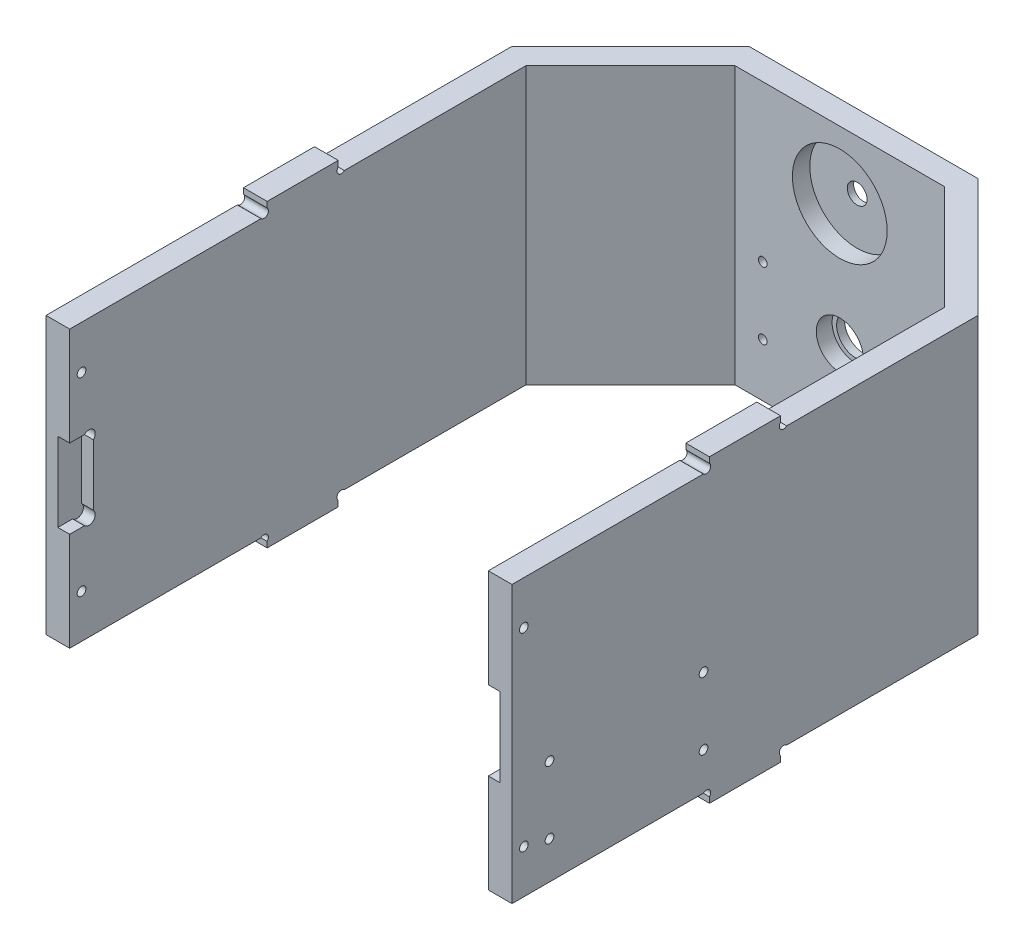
ISO-10303-21;
HEADER;
FILE_DESCRIPTION(('STEP AP214'),'2;1');
FILE_NAME('part.step','',(''),(''),'','','');
FILE_SCHEMA(('AUTOMOTIVE_DESIGN { 1 0 10303 214 1 1 1 1 }'));
ENDSEC;
DATA;
#1=APPLICATION_CONTEXT('core data for automotive mechanical design processes');
#2=APPLICATION_PROTOCOL_DEFINITION('international standard','automotive_design',2000,#1);
#3=PRODUCT_CONTEXT('',#1,'mechanical');
#4=PRODUCT('Part','Part','',(#3));
#5=PRODUCT_RELATED_PRODUCT_CATEGORY('part','',(#4));
#6=PRODUCT_DEFINITION_FORMATION('','',#4);
#7=PRODUCT_DEFINITION_CONTEXT('part definition',#1,'design');
#8=PRODUCT_DEFINITION('design','',#6,#7);
#9=PRODUCT_DEFINITION_SHAPE('','',#8);
#10=(LENGTH_UNIT() NAMED_UNIT(*) SI_UNIT(.MILLI.,.METRE.));
#11=(NAMED_UNIT(*) PLANE_ANGLE_UNIT() SI_UNIT($,.RADIAN.));
#12=(NAMED_UNIT(*) SI_UNIT($,.STERADIAN.) SOLID_ANGLE_UNIT());
#13=UNCERTAINTY_MEASURE_WITH_UNIT(LENGTH_MEASURE(1.E-05),#10,'distance_accuracy_value','');
#14=(GEOMETRIC_REPRESENTATION_CONTEXT(3) GLOBAL_UNCERTAINTY_ASSIGNED_CONTEXT((#13)) GLOBAL_UNIT_ASSIGNED_CONTEXT((#10,
#11,#12)) REPRESENTATION_CONTEXT('',''));
#15=CARTESIAN_POINT('',(0.,0.,0.));
#16=DIRECTION('',(0.,0.,1.));
#17=DIRECTION('',(1.,0.,0.));
#18=AXIS2_PLACEMENT_3D('',#15,#16,#17);
#19=CARTESIAN_POINT('',(0.,56.,-89.));
#20=DIRECTION('',(0.,0.,1.));
#21=DIRECTION('',(1.,0.,0.));
#22=AXIS2_PLACEMENT_3D('',#19,#20,#21);
#23=CYLINDRICAL_SURFACE('',#22,2.5);
#24=CARTESIAN_POINT('',(0.,56.,-89.));
#25=DIRECTION('',(0.,0.,1.));
#26=DIRECTION('',(1.,0.,0.));
#27=AXIS2_PLACEMENT_3D('',#24,#25,#26);
#28=CIRCLE('',#27,2.5);
#29=CARTESIAN_POINT('',(2.50000000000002,56.,-89.));
#30=VERTEX_POINT('',#29);
#31=EDGE_CURVE('E653',#30,#30,#28,.T.);
#32=ORIENTED_EDGE('',*,*,#31,.F.);
#33=EDGE_LOOP('',(#32));
#34=FACE_BOUND('',#33,.T.);
#35=CARTESIAN_POINT('',(0.,56.,-87.3999999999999));
#36=DIRECTION('',(0.,0.,1.));
#37=DIRECTION('',(1.,0.,0.));
#38=AXIS2_PLACEMENT_3D('',#35,#36,#37);
#39=CIRCLE('',#38,2.5);
#40=CARTESIAN_POINT('',(2.50000000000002,56.,-87.3999999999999));
#41=VERTEX_POINT('',#40);
#42=EDGE_CURVE('E36',#41,#41,#39,.F.);
#43=ORIENTED_EDGE('',*,*,#42,.F.);
#44=EDGE_LOOP('',(#43));
#45=FACE_BOUND('',#44,.T.);
#46=ADVANCED_FACE('F32',(#34,#45),#23,.F.);
#47=CARTESIAN_POINT('',(0.,0.,0.));
#48=DIRECTION('',(0.,-1.,0.));
#49=DIRECTION('',(0.,0.,-1.));
#50=AXIS2_PLACEMENT_3D('',#47,#48,#49);
#51=PLANE('',#50);
#52=DIRECTION('',(-1.,0.,0.));
#53=VECTOR('',#52,1.);
#54=CARTESIAN_POINT('',(59.,0.,-9.00000000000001));
#55=LINE('',#54,#53);
#56=CARTESIAN_POINT('',(59.,0.,-9.00000000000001));
#57=VERTEX_POINT('',#56);
#58=CARTESIAN_POINT('',(53.,0.,-9.00000000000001));
#59=VERTEX_POINT('',#58);
#60=EDGE_CURVE('E383',#57,#59,#55,.T.);
#61=ORIENTED_EDGE('',*,*,#60,.F.);
#62=DIRECTION('',(0.,0.,-1.));
#63=VECTOR('',#62,1.);
#64=CARTESIAN_POINT('',(59.,0.,-59.));
#65=LINE('',#64,#63);
#66=CARTESIAN_POINT('',(59.,0.,9.));
#67=VERTEX_POINT('',#66);
#68=EDGE_CURVE('E683',#67,#57,#65,.T.);
#69=ORIENTED_EDGE('',*,*,#68,.F.);
#70=DIRECTION('',(-1.,0.,0.));
#71=VECTOR('',#70,1.);
#72=CARTESIAN_POINT('',(59.,0.,9.));
#73=LINE('',#72,#71);
#74=CARTESIAN_POINT('',(53.,0.,9.));
#75=VERTEX_POINT('',#74);
#76=EDGE_CURVE('E435',#67,#75,#73,.T.);
#77=ORIENTED_EDGE('',*,*,#76,.T.);
#78=DIRECTION('',(0.,0.,1.));
#79=VECTOR('',#78,1.);
#80=CARTESIAN_POINT('',(53.,0.,59.));
#81=LINE('',#80,#79);
#82=EDGE_CURVE('E688',#59,#75,#81,.T.);
#83=ORIENTED_EDGE('',*,*,#82,.F.);
#84=EDGE_LOOP('',(#61,#69,#77,#83));
#85=FACE_BOUND('',#84,.T.);
#86=ADVANCED_FACE('F856',(#85),#51,.T.);
#87=CARTESIAN_POINT('',(0.,76.,0.));
#88=DIRECTION('',(0.,-1.,0.));
#89=DIRECTION('',(0.,0.,-1.));
#90=AXIS2_PLACEMENT_3D('',#87,#88,#89);
#91=PLANE('',#90);
#92=DIRECTION('',(0.,0.,-1.));
#93=VECTOR('',#92,1.);
#94=CARTESIAN_POINT('',(59.,76.,-59.));
#95=LINE('',#94,#93);
#96=CARTESIAN_POINT('',(59.,76.,8.99999999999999));
#97=VERTEX_POINT('',#96);
#98=CARTESIAN_POINT('',(59.,76.,-9.00000000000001));
#99=VERTEX_POINT('',#98);
#100=EDGE_CURVE('E684',#97,#99,#95,.T.);
#101=ORIENTED_EDGE('',*,*,#100,.T.);
#102=DIRECTION('',(-1.,0.,0.));
#103=VECTOR('',#102,1.);
#104=CARTESIAN_POINT('',(59.,76.,-9.00000000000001));
#105=LINE('',#104,#103);
#106=CARTESIAN_POINT('',(53.,76.,-9.00000000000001));
#107=VERTEX_POINT('',#106);
#108=EDGE_CURVE('E477',#99,#107,#105,.T.);
#109=ORIENTED_EDGE('',*,*,#108,.T.);
#110=DIRECTION('',(0.,0.,1.));
#111=VECTOR('',#110,1.);
#112=CARTESIAN_POINT('',(53.,76.,59.));
#113=LINE('',#112,#111);
#114=CARTESIAN_POINT('',(53.,76.,9.));
#115=VERTEX_POINT('',#114);
#116=EDGE_CURVE('E693',#107,#115,#113,.T.);
#117=ORIENTED_EDGE('',*,*,#116,.T.);
#118=DIRECTION('',(-1.,0.,0.));
#119=VECTOR('',#118,1.);
#120=CARTESIAN_POINT('',(59.,76.,9.));
#121=LINE('',#120,#119);
#122=EDGE_CURVE('E532',#97,#115,#121,.T.);
#123=ORIENTED_EDGE('',*,*,#122,.F.);
#124=EDGE_LOOP('',(#101,#109,#117,#123));
#125=FACE_BOUND('',#124,.T.);
#126=ADVANCED_FACE('F827',(#125),#91,.F.);
#127=CARTESIAN_POINT('',(0.,25.,-89.));
#128=DIRECTION('',(0.,0.,1.));
#129=DIRECTION('',(1.,0.,0.));
#130=AXIS2_PLACEMENT_3D('',#127,#128,#129);
#131=CYLINDRICAL_SURFACE('',#130,4.8);
#132=CARTESIAN_POINT('',(0.,25.,-89.));
#133=DIRECTION('',(0.,0.,1.));
#134=DIRECTION('',(1.,0.,0.));
#135=AXIS2_PLACEMENT_3D('',#132,#133,#134);
#136=CIRCLE('',#135,4.8);
#137=CARTESIAN_POINT('',(4.80000000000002,25.,-89.));
#138=VERTEX_POINT('',#137);
#139=EDGE_CURVE('E678',#138,#138,#136,.T.);
#140=ORIENTED_EDGE('',*,*,#139,.F.);
#141=EDGE_LOOP('',(#140));
#142=FACE_BOUND('',#141,.T.);
#143=CARTESIAN_POINT('',(0.,25.,-87.));
#144=DIRECTION('',(0.,0.,1.));
#145=DIRECTION('',(1.,0.,0.));
#146=AXIS2_PLACEMENT_3D('',#143,#144,#145);
#147=CIRCLE('',#146,4.8);
#148=CARTESIAN_POINT('',(4.80000000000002,25.,-87.));
#149=VERTEX_POINT('',#148);
#150=EDGE_CURVE('E650',#149,#149,#147,.F.);
#151=ORIENTED_EDGE('',*,*,#150,.F.);
#152=EDGE_LOOP('',(#151));
#153=FACE_BOUND('',#152,.T.);
#154=ADVANCED_FACE('F904',(#142,#153),#131,.F.);
#155=CARTESIAN_POINT('',(53.,76.,59.));
#156=DIRECTION('',(0.,0.,-1.));
#157=DIRECTION('',(-1.,0.,0.));
#158=AXIS2_PLACEMENT_3D('',#155,#156,#157);
#159=PLANE('',#158);
#160=DIRECTION('',(0.,-1.,0.));
#161=VECTOR('',#160,1.);
#162=CARTESIAN_POINT('',(53.,76.,59.));
#163=LINE('',#162,#161);
#164=CARTESIAN_POINT('',(53.,28.,59.));
#165=VERTEX_POINT('',#164);
#166=CARTESIAN_POINT('',(53.,3.,59.));
#167=VERTEX_POINT('',#166);
#168=EDGE_CURVE('E695',#165,#167,#163,.T.);
#169=ORIENTED_EDGE('',*,*,#168,.T.);
#170=DIRECTION('',(-1.,0.,0.));
#171=VECTOR('',#170,1.);
#172=CARTESIAN_POINT('',(59.,3.,59.));
#173=LINE('',#172,#171);
#174=CARTESIAN_POINT('',(59.,3.,59.));
#175=VERTEX_POINT('',#174);
#176=EDGE_CURVE('E432',#175,#167,#173,.T.);
#177=ORIENTED_EDGE('',*,*,#176,.F.);
#178=DIRECTION('',(0.,-1.,0.));
#179=VECTOR('',#178,1.);
#180=CARTESIAN_POINT('',(59.,76.,59.));
#181=LINE('',#180,#179);
#182=CARTESIAN_POINT('',(59.,73.,59.));
#183=VERTEX_POINT('',#182);
#184=EDGE_CURVE('E733',#183,#175,#181,.T.);
#185=ORIENTED_EDGE('',*,*,#184,.F.);
#186=DIRECTION('',(-1.,0.,0.));
#187=VECTOR('',#186,1.);
#188=CARTESIAN_POINT('',(59.,73.,59.));
#189=LINE('',#188,#187);
#190=CARTESIAN_POINT('',(53.,73.,59.));
#191=VERTEX_POINT('',#190);
#192=EDGE_CURVE('E535',#183,#191,#189,.T.);
#193=ORIENTED_EDGE('',*,*,#192,.T.);
#194=CARTESIAN_POINT('',(53.,48.,59.));
#195=VERTEX_POINT('',#194);
#196=EDGE_CURVE('E702',#191,#195,#163,.T.);
#197=ORIENTED_EDGE('',*,*,#196,.T.);
#198=DIRECTION('',(1.,0.,0.));
#199=VECTOR('',#198,1.);
#200=CARTESIAN_POINT('',(-56.,48.,59.));
#201=LINE('',#200,#199);
#202=CARTESIAN_POINT('',(56.,48.,59.));
#203=VERTEX_POINT('',#202);
#204=EDGE_CURVE('E629',#195,#203,#201,.T.);
#205=ORIENTED_EDGE('',*,*,#204,.T.);
#206=DIRECTION('',(0.,-1.,0.));
#207=VECTOR('',#206,1.);
#208=CARTESIAN_POINT('',(56.,48.,59.));
#209=LINE('',#208,#207);
#210=CARTESIAN_POINT('',(56.,28.,59.));
#211=VERTEX_POINT('',#210);
#212=EDGE_CURVE('E599',#203,#211,#209,.T.);
#213=ORIENTED_EDGE('',*,*,#212,.T.);
#214=DIRECTION('',(1.,0.,0.));
#215=VECTOR('',#214,1.);
#216=CARTESIAN_POINT('',(-56.,28.,59.));
#217=LINE('',#216,#215);
#218=EDGE_CURVE('E625',#165,#211,#217,.T.);
#219=ORIENTED_EDGE('',*,*,#218,.F.);
#220=EDGE_LOOP('',(#169,#177,#185,#193,#197,#205,#213,#219));
#221=FACE_BOUND('',#220,.T.);
#222=ADVANCED_FACE('F34',(#221),#159,.F.);
#223=CARTESIAN_POINT('',(59.,76.,-59.));
#224=DIRECTION('',(-1.,0.,0.));
#225=DIRECTION('',(0.,0.,1.));
#226=AXIS2_PLACEMENT_3D('',#223,#224,#225);
#227=PLANE('',#226);
#228=CARTESIAN_POINT('',(59.,29.5,10.5));
#229=DIRECTION('',(-1.,0.,0.));
#230=DIRECTION('',(0.,0.,-1.));
#231=AXIS2_PLACEMENT_3D('',#228,#229,#230);
#232=CIRCLE('',#231,1.1);
#233=CARTESIAN_POINT('',(59.,29.5,9.40000000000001));
#234=VERTEX_POINT('',#233);
#235=EDGE_CURVE('E948',#234,#234,#232,.T.);
#236=ORIENTED_EDGE('',*,*,#235,.T.);
#237=EDGE_LOOP('',(#236));
#238=FACE_BOUND('',#237,.T.);
#239=CARTESIAN_POINT('',(59.,29.5,49.5));
#240=DIRECTION('',(-1.,0.,0.));
#241=DIRECTION('',(0.,0.,1.));
#242=AXIS2_PLACEMENT_3D('',#239,#240,#241);
#243=CIRCLE('',#242,1.09999999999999);
#244=CARTESIAN_POINT('',(59.,29.5,50.6));
#245=VERTEX_POINT('',#244);
#246=EDGE_CURVE('E952',#245,#245,#243,.T.);
#247=ORIENTED_EDGE('',*,*,#246,.T.);
#248=EDGE_LOOP('',(#247));
#249=FACE_BOUND('',#248,.T.);
#250=CARTESIAN_POINT('',(59.,12.5,49.5));
#251=DIRECTION('',(-1.,0.,0.));
#252=DIRECTION('',(0.,0.,-1.));
#253=AXIS2_PLACEMENT_3D('',#250,#251,#252);
#254=CIRCLE('',#253,1.09999999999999);
#255=CARTESIAN_POINT('',(59.,12.5,48.4));
#256=VERTEX_POINT('',#255);
#257=EDGE_CURVE('E956',#256,#256,#254,.T.);
#258=ORIENTED_EDGE('',*,*,#257,.T.);
#259=EDGE_LOOP('',(#258));
#260=FACE_BOUND('',#259,.T.);
#261=CARTESIAN_POINT('',(59.,12.5,10.5));
#262=DIRECTION('',(-1.,0.,0.));
#263=DIRECTION('',(0.,0.,1.));
#264=AXIS2_PLACEMENT_3D('',#261,#262,#263);
#265=CIRCLE('',#264,1.1);
#266=CARTESIAN_POINT('',(59.,12.5,11.6));
#267=VERTEX_POINT('',#266);
#268=EDGE_CURVE('E960',#267,#267,#265,.T.);
#269=ORIENTED_EDGE('',*,*,#268,.T.);
#270=EDGE_LOOP('',(#269));
#271=FACE_BOUND('',#270,.T.);
#272=CARTESIAN_POINT('',(59.,14.,56.));
#273=DIRECTION('',(1.,0.,0.));
#274=DIRECTION('',(0.,0.,1.));
#275=AXIS2_PLACEMENT_3D('',#272,#273,#274);
#276=CIRCLE('',#275,1.09999999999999);
#277=CARTESIAN_POINT('',(59.,14.,57.1));
#278=VERTEX_POINT('',#277);
#279=EDGE_CURVE('E553',#278,#278,#276,.T.);
#280=ORIENTED_EDGE('',*,*,#279,.F.);
#281=EDGE_LOOP('',(#280));
#282=FACE_BOUND('',#281,.T.);
#283=CARTESIAN_POINT('',(59.,62.,56.));
#284=DIRECTION('',(1.,0.,0.));
#285=DIRECTION('',(0.,0.,-1.));
#286=AXIS2_PLACEMENT_3D('',#283,#284,#285);
#287=CIRCLE('',#286,1.1);
#288=CARTESIAN_POINT('',(59.,62.,54.9));
#289=VERTEX_POINT('',#288);
#290=EDGE_CURVE('E563',#289,#289,#287,.T.);
#291=ORIENTED_EDGE('',*,*,#290,.F.);
#292=EDGE_LOOP('',(#291));
#293=FACE_BOUND('',#292,.T.);
#294=ORIENTED_EDGE('',*,*,#68,.T.);
#295=DIRECTION('',(0.,1.,0.));
#296=VECTOR('',#295,1.);
#297=CARTESIAN_POINT('',(59.,1.44436508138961,-9.00000000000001));
#298=LINE('',#297,#296);
#299=CARTESIAN_POINT('',(59.,1.44436508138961,-9.00000000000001));
#300=VERTEX_POINT('',#299);
#301=EDGE_CURVE('E361',#57,#300,#298,.T.);
#302=ORIENTED_EDGE('',*,*,#301,.T.);
#303=CARTESIAN_POINT('',(59.,2.22218254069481,-9.77781745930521));
#304=DIRECTION('',(-1.,0.,0.));
#305=DIRECTION('',(0.,0.,1.));
#306=AXIS2_PLACEMENT_3D('',#303,#304,#305);
#307=CIRCLE('',#306,1.10000000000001);
#308=CARTESIAN_POINT('',(59.,3.00000000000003,-10.5556349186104));
#309=VERTEX_POINT('',#308);
#310=EDGE_CURVE('E346',#300,#309,#307,.T.);
#311=ORIENTED_EDGE('',*,*,#310,.T.);
#312=DIRECTION('',(0.,0.,-1.));
#313=VECTOR('',#312,1.);
#314=CARTESIAN_POINT('',(59.,3.00000000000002,-89.));
#315=LINE('',#314,#313);
#316=CARTESIAN_POINT('',(59.,3.00000000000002,-59.));
#317=VERTEX_POINT('',#316);
#318=EDGE_CURVE('E354',#309,#317,#315,.T.);
#319=ORIENTED_EDGE('',*,*,#318,.T.);
#320=DIRECTION('',(0.,-1.,0.));
#321=VECTOR('',#320,1.);
#322=CARTESIAN_POINT('',(59.,76.,-59.));
#323=LINE('',#322,#321);
#324=CARTESIAN_POINT('',(59.,73.,-59.));
#325=VERTEX_POINT('',#324);
#326=EDGE_CURVE('E731',#325,#317,#323,.T.);
#327=ORIENTED_EDGE('',*,*,#326,.F.);
#328=DIRECTION('',(0.,0.,1.));
#329=VECTOR('',#328,1.);
#330=CARTESIAN_POINT('',(59.,73.,-89.));
#331=LINE('',#330,#329);
#332=CARTESIAN_POINT('',(59.,73.,-10.5556349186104));
#333=VERTEX_POINT('',#332);
#334=EDGE_CURVE('E460',#325,#333,#331,.T.);
#335=ORIENTED_EDGE('',*,*,#334,.T.);
#336=CARTESIAN_POINT('',(59.,73.7778174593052,-9.77781745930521));
#337=DIRECTION('',(-1.,0.,0.));
#338=DIRECTION('',(0.,0.,-1.));
#339=AXIS2_PLACEMENT_3D('',#336,#337,#338);
#340=CIRCLE('',#339,1.10000000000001);
#341=CARTESIAN_POINT('',(59.,74.5556349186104,-9.00000000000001));
#342=VERTEX_POINT('',#341);
#343=EDGE_CURVE('E453',#333,#342,#340,.T.);
#344=ORIENTED_EDGE('',*,*,#343,.T.);
#345=DIRECTION('',(0.,1.,0.));
#346=VECTOR('',#345,1.);
#347=CARTESIAN_POINT('',(59.,74.5556349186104,-9.00000000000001));
#348=LINE('',#347,#346);
#349=EDGE_CURVE('E456',#342,#99,#348,.T.);
#350=ORIENTED_EDGE('',*,*,#349,.T.);
#351=ORIENTED_EDGE('',*,*,#100,.F.);
#352=DIRECTION('',(0.,-1.,0.));
#353=VECTOR('',#352,1.);
#354=CARTESIAN_POINT('',(59.,74.5556349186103,9.));
#355=LINE('',#354,#353);
#356=CARTESIAN_POINT('',(59.,74.5556349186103,9.));
#357=VERTEX_POINT('',#356);
#358=EDGE_CURVE('E517',#97,#357,#355,.T.);
#359=ORIENTED_EDGE('',*,*,#358,.T.);
#360=CARTESIAN_POINT('',(59.,73.7778174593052,9.77781745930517));
#361=DIRECTION('',(-1.,0.,0.));
#362=DIRECTION('',(0.,0.,1.));
#363=AXIS2_PLACEMENT_3D('',#360,#361,#362);
#364=CIRCLE('',#363,1.09999999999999);
#365=CARTESIAN_POINT('',(59.,73.,10.5556349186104));
#366=VERTEX_POINT('',#365);
#367=EDGE_CURVE('E510',#357,#366,#364,.T.);
#368=ORIENTED_EDGE('',*,*,#367,.T.);
#369=DIRECTION('',(0.,0.,1.));
#370=VECTOR('',#369,1.);
#371=CARTESIAN_POINT('',(59.,73.,10.5556349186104));
#372=LINE('',#371,#370);
#373=EDGE_CURVE('E513',#366,#183,#372,.T.);
#374=ORIENTED_EDGE('',*,*,#373,.T.);
#375=ORIENTED_EDGE('',*,*,#184,.T.);
#376=DIRECTION('',(0.,0.,-1.));
#377=VECTOR('',#376,1.);
#378=CARTESIAN_POINT('',(59.,3.00000000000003,10.5556349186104));
#379=LINE('',#378,#377);
#380=CARTESIAN_POINT('',(59.,3.00000000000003,10.5556349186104));
#381=VERTEX_POINT('',#380);
#382=EDGE_CURVE('E417',#175,#381,#379,.T.);
#383=ORIENTED_EDGE('',*,*,#382,.T.);
#384=CARTESIAN_POINT('',(59.,2.22218254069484,9.77781745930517));
#385=DIRECTION('',(-1.,0.,0.));
#386=DIRECTION('',(0.,0.,-1.));
#387=AXIS2_PLACEMENT_3D('',#384,#385,#386);
#388=CIRCLE('',#387,1.09999999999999);
#389=CARTESIAN_POINT('',(59.,1.44436508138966,9.));
#390=VERTEX_POINT('',#389);
#391=EDGE_CURVE('E410',#381,#390,#388,.T.);
#392=ORIENTED_EDGE('',*,*,#391,.T.);
#393=DIRECTION('',(0.,-1.,0.));
#394=VECTOR('',#393,1.);
#395=CARTESIAN_POINT('',(59.,1.44436508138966,9.));
#396=LINE('',#395,#394);
#397=EDGE_CURVE('E413',#390,#67,#396,.T.);
#398=ORIENTED_EDGE('',*,*,#397,.T.);
#399=EDGE_LOOP('',(#294,#302,#311,#319,#327,#335,#344,#350,#351,#359,#368,#374,#375,#383,#392,#398));
#400=FACE_BOUND('',#399,.T.);
#401=ADVANCED_FACE('F364',(#238,#249,#260,#271,#282,#293,#400),#227,.F.);
#402=CARTESIAN_POINT('',(59.,76.,-59.));
#403=DIRECTION('',(-0.707106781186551,0.,0.707106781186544));
#404=DIRECTION('',(0.707106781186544,0.,0.707106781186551));
#405=AXIS2_PLACEMENT_3D('',#402,#403,#404);
#406=PLANE('',#405);
#407=ORIENTED_EDGE('',*,*,#326,.T.);
#408=DIRECTION('',(-0.707106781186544,0.,-0.707106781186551));
#409=VECTOR('',#408,1.);
#410=CARTESIAN_POINT('',(59.,3.00000000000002,-59.));
#411=LINE('',#410,#409);
#412=CARTESIAN_POINT('',(29.0000000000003,3.00000000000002,-89.));
#413=VERTEX_POINT('',#412);
#414=EDGE_CURVE('E357',#317,#413,#411,.T.);
#415=ORIENTED_EDGE('',*,*,#414,.T.);
#416=DIRECTION('',(0.,-1.,0.));
#417=VECTOR('',#416,1.);
#418=CARTESIAN_POINT('',(29.0000000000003,76.,-89.));
#419=LINE('',#418,#417);
#420=CARTESIAN_POINT('',(29.0000000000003,73.,-89.));
#421=VERTEX_POINT('',#420);
#422=EDGE_CURVE('E728',#421,#413,#419,.T.);
#423=ORIENTED_EDGE('',*,*,#422,.F.);
#424=DIRECTION('',(0.707106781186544,0.,0.707106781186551));
#425=VECTOR('',#424,1.);
#426=CARTESIAN_POINT('',(59.,73.,-59.));
#427=LINE('',#426,#425);
#428=EDGE_CURVE('E503',#421,#325,#427,.T.);
#429=ORIENTED_EDGE('',*,*,#428,.T.);
#430=EDGE_LOOP('',(#407,#415,#423,#429));
#431=FACE_BOUND('',#430,.T.);
#432=ADVANCED_FACE('F815',(#431),#406,.F.);
#433=CARTESIAN_POINT('',(-29.0000000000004,76.,-89.));
#434=DIRECTION('',(0.,0.,1.));
#435=DIRECTION('',(1.,0.,0.));
#436=AXIS2_PLACEMENT_3D('',#433,#434,#435);
#437=PLANE('',#436);
#438=ORIENTED_EDGE('',*,*,#31,.T.);
#439=EDGE_LOOP('',(#438));
#440=FACE_BOUND('',#439,.T.);
#441=CARTESIAN_POINT('',(-19.5,33.5,-89.));
#442=DIRECTION('',(0.,0.,1.));
#443=DIRECTION('',(1.,0.,0.));
#444=AXIS2_PLACEMENT_3D('',#441,#442,#443);
#445=CIRCLE('',#444,1.1);
#446=CARTESIAN_POINT('',(-18.4,33.5,-89.));
#447=VERTEX_POINT('',#446);
#448=EDGE_CURVE('E657',#447,#447,#445,.T.);
#449=ORIENTED_EDGE('',*,*,#448,.T.);
#450=EDGE_LOOP('',(#449));
#451=FACE_BOUND('',#450,.T.);
#452=CARTESIAN_POINT('',(-19.5,16.5,-89.));
#453=DIRECTION('',(0.,0.,1.));
#454=DIRECTION('',(-1.,0.,0.));
#455=AXIS2_PLACEMENT_3D('',#452,#453,#454);
#456=CIRCLE('',#455,1.1);
#457=CARTESIAN_POINT('',(-20.6,16.5,-89.));
#458=VERTEX_POINT('',#457);
#459=EDGE_CURVE('E663',#458,#458,#456,.T.);
#460=ORIENTED_EDGE('',*,*,#459,.T.);
#461=EDGE_LOOP('',(#460));
#462=FACE_BOUND('',#461,.T.);
#463=CARTESIAN_POINT('',(19.5,33.5,-89.));
#464=DIRECTION('',(0.,0.,1.));
#465=DIRECTION('',(-1.,0.,0.));
#466=AXIS2_PLACEMENT_3D('',#463,#464,#465);
#467=CIRCLE('',#466,1.1);
#468=CARTESIAN_POINT('',(18.4,33.5,-89.));
#469=VERTEX_POINT('',#468);
#470=EDGE_CURVE('E669',#469,#469,#467,.T.);
#471=ORIENTED_EDGE('',*,*,#470,.T.);
#472=EDGE_LOOP('',(#471));
#473=FACE_BOUND('',#472,.T.);
#474=CARTESIAN_POINT('',(19.5,16.5,-89.));
#475=DIRECTION('',(0.,0.,1.));
#476=DIRECTION('',(1.,0.,0.));
#477=AXIS2_PLACEMENT_3D('',#474,#475,#476);
#478=CIRCLE('',#477,1.1);
#479=CARTESIAN_POINT('',(20.6,16.5,-89.));
#480=VERTEX_POINT('',#479);
#481=EDGE_CURVE('E675',#480,#480,#478,.T.);
#482=ORIENTED_EDGE('',*,*,#481,.T.);
#483=EDGE_LOOP('',(#482));
#484=FACE_BOUND('',#483,.T.);
#485=ORIENTED_EDGE('',*,*,#139,.T.);
#486=EDGE_LOOP('',(#485));
#487=FACE_BOUND('',#486,.T.);
#488=ORIENTED_EDGE('',*,*,#422,.T.);
#489=DIRECTION('',(-1.,0.,0.));
#490=VECTOR('',#489,1.);
#491=CARTESIAN_POINT('',(59.,3.00000000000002,-89.));
#492=LINE('',#491,#490);
#493=CARTESIAN_POINT('',(-29.0000000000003,3.00000000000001,-89.));
#494=VERTEX_POINT('',#493);
#495=EDGE_CURVE('E350',#413,#494,#492,.T.);
#496=ORIENTED_EDGE('',*,*,#495,.T.);
#497=DIRECTION('',(0.,-1.,0.));
#498=VECTOR('',#497,1.);
#499=CARTESIAN_POINT('',(-29.0000000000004,76.,-89.));
#500=LINE('',#499,#498);
#501=CARTESIAN_POINT('',(-29.0000000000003,73.,-89.));
#502=VERTEX_POINT('',#501);
#503=EDGE_CURVE('E725',#502,#494,#500,.T.);
#504=ORIENTED_EDGE('',*,*,#503,.F.);
#505=DIRECTION('',(-1.,0.,0.));
#506=VECTOR('',#505,1.);
#507=CARTESIAN_POINT('',(59.,73.,-89.));
#508=LINE('',#507,#506);
#509=EDGE_CURVE('E475',#421,#502,#508,.T.);
#510=ORIENTED_EDGE('',*,*,#509,.F.);
#511=EDGE_LOOP('',(#488,#496,#504,#510));
#512=FACE_BOUND('',#511,.T.);
#513=ADVANCED_FACE('F812',(#440,#451,#462,#473,#484,#487,#512),#437,.F.);
#514=CARTESIAN_POINT('',(-59.,76.,-59.));
#515=DIRECTION('',(0.707106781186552,0.,0.707106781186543));
#516=DIRECTION('',(0.707106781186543,0.,-0.707106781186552));
#517=AXIS2_PLACEMENT_3D('',#514,#515,#516);
#518=PLANE('',#517);
#519=ORIENTED_EDGE('',*,*,#503,.T.);
#520=DIRECTION('',(-0.707106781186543,0.,0.707106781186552));
#521=VECTOR('',#520,1.);
#522=CARTESIAN_POINT('',(-59.,3.00000000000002,-59.));
#523=LINE('',#522,#521);
#524=CARTESIAN_POINT('',(-59.,3.00000000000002,-59.));
#525=VERTEX_POINT('',#524);
#526=EDGE_CURVE('E402',#494,#525,#523,.T.);
#527=ORIENTED_EDGE('',*,*,#526,.T.);
#528=DIRECTION('',(0.,-1.,0.));
#529=VECTOR('',#528,1.);
#530=CARTESIAN_POINT('',(-59.,76.,-59.));
#531=LINE('',#530,#529);
#532=CARTESIAN_POINT('',(-59.,73.,-59.));
#533=VERTEX_POINT('',#532);
#534=EDGE_CURVE('E722',#533,#525,#531,.T.);
#535=ORIENTED_EDGE('',*,*,#534,.F.);
#536=DIRECTION('',(0.707106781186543,0.,-0.707106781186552));
#537=VECTOR('',#536,1.);
#538=CARTESIAN_POINT('',(-59.,73.,-59.));
#539=LINE('',#538,#537);
#540=EDGE_CURVE('E500',#533,#502,#539,.T.);
#541=ORIENTED_EDGE('',*,*,#540,.T.);
#542=EDGE_LOOP('',(#519,#527,#535,#541));
#543=FACE_BOUND('',#542,.T.);
#544=ADVANCED_FACE('F808',(#543),#518,.F.);
#545=CARTESIAN_POINT('',(-59.,76.,-59.));
#546=DIRECTION('',(1.,0.,0.));
#547=DIRECTION('',(0.,0.,-1.));
#548=AXIS2_PLACEMENT_3D('',#545,#546,#547);
#549=PLANE('',#548);
#550=CARTESIAN_POINT('',(-59.,14.,56.));
#551=DIRECTION('',(1.,0.,0.));
#552=DIRECTION('',(0.,0.,1.));
#553=AXIS2_PLACEMENT_3D('',#550,#551,#552);
#554=CIRCLE('',#553,1.09999999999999);
#555=CARTESIAN_POINT('',(-59.,14.,57.1));
#556=VERTEX_POINT('',#555);
#557=EDGE_CURVE('E554',#556,#556,#554,.T.);
#558=ORIENTED_EDGE('',*,*,#557,.T.);
#559=EDGE_LOOP('',(#558));
#560=FACE_BOUND('',#559,.T.);
#561=CARTESIAN_POINT('',(-59.,62.,56.));
#562=DIRECTION('',(1.,0.,0.));
#563=DIRECTION('',(0.,0.,-1.));
#564=AXIS2_PLACEMENT_3D('',#561,#562,#563);
#565=CIRCLE('',#564,1.1);
#566=CARTESIAN_POINT('',(-59.,62.,54.9));
#567=VERTEX_POINT('',#566);
#568=EDGE_CURVE('E564',#567,#567,#565,.T.);
#569=ORIENTED_EDGE('',*,*,#568,.T.);
#570=EDGE_LOOP('',(#569));
#571=FACE_BOUND('',#570,.T.);
#572=CARTESIAN_POINT('',(-59.,2.22218254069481,-9.7778174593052));
#573=DIRECTION('',(-1.,0.,0.));
#574=DIRECTION('',(0.,0.,1.));
#575=AXIS2_PLACEMENT_3D('',#572,#573,#574);
#576=CIRCLE('',#575,1.10000000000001);
#577=CARTESIAN_POINT('',(-59.,1.44436508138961,-9.));
#578=VERTEX_POINT('',#577);
#579=CARTESIAN_POINT('',(-59.,3.00000000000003,-10.5556349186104));
#580=VERTEX_POINT('',#579);
#581=EDGE_CURVE('E375',#578,#580,#576,.T.);
#582=ORIENTED_EDGE('',*,*,#581,.F.);
#583=DIRECTION('',(0.,1.,0.));
#584=VECTOR('',#583,1.);
#585=CARTESIAN_POINT('',(-59.,1.44436508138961,-9.));
#586=LINE('',#585,#584);
#587=CARTESIAN_POINT('',(-59.,0.,-9.));
#588=VERTEX_POINT('',#587);
#589=EDGE_CURVE('E365',#588,#578,#586,.T.);
#590=ORIENTED_EDGE('',*,*,#589,.F.);
#591=DIRECTION('',(0.,0.,1.));
#592=VECTOR('',#591,1.);
#593=CARTESIAN_POINT('',(-59.,0.,-59.));
#594=LINE('',#593,#592);
#595=CARTESIAN_POINT('',(-59.,0.,9.00000000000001));
#596=VERTEX_POINT('',#595);
#597=EDGE_CURVE('E56',#588,#596,#594,.T.);
#598=ORIENTED_EDGE('',*,*,#597,.T.);
#599=DIRECTION('',(0.,-1.,0.));
#600=VECTOR('',#599,1.);
#601=CARTESIAN_POINT('',(-59.,1.44436508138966,9.00000000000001));
#602=LINE('',#601,#600);
#603=CARTESIAN_POINT('',(-59.,1.44436508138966,9.00000000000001));
#604=VERTEX_POINT('',#603);
#605=EDGE_CURVE('E423',#604,#596,#602,.T.);
#606=ORIENTED_EDGE('',*,*,#605,.F.);
#607=CARTESIAN_POINT('',(-59.,2.22218254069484,9.77781745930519));
#608=DIRECTION('',(-1.,0.,0.));
#609=DIRECTION('',(0.,0.,-1.));
#610=AXIS2_PLACEMENT_3D('',#607,#608,#609);
#611=CIRCLE('',#610,1.09999999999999);
#612=CARTESIAN_POINT('',(-59.,3.00000000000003,10.5556349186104));
#613=VERTEX_POINT('',#612);
#614=EDGE_CURVE('E409',#613,#604,#611,.T.);
#615=ORIENTED_EDGE('',*,*,#614,.F.);
#616=DIRECTION('',(0.,0.,-1.));
#617=VECTOR('',#616,1.);
#618=CARTESIAN_POINT('',(-59.,3.00000000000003,10.5556349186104));
#619=LINE('',#618,#617);
#620=CARTESIAN_POINT('',(-59.,3.,59.));
#621=VERTEX_POINT('',#620);
#622=EDGE_CURVE('E414',#621,#613,#619,.T.);
#623=ORIENTED_EDGE('',*,*,#622,.F.);
#624=DIRECTION('',(0.,-1.,0.));
#625=VECTOR('',#624,1.);
#626=CARTESIAN_POINT('',(-59.,76.,59.));
#627=LINE('',#626,#625);
#628=CARTESIAN_POINT('',(-59.,73.,59.));
#629=VERTEX_POINT('',#628);
#630=EDGE_CURVE('E719',#629,#621,#627,.T.);
#631=ORIENTED_EDGE('',*,*,#630,.F.);
#632=DIRECTION('',(0.,0.,1.));
#633=VECTOR('',#632,1.);
#634=CARTESIAN_POINT('',(-59.,73.,10.5556349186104));
#635=LINE('',#634,#633);
#636=CARTESIAN_POINT('',(-59.,73.,10.5556349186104));
#637=VERTEX_POINT('',#636);
#638=EDGE_CURVE('E523',#637,#629,#635,.T.);
#639=ORIENTED_EDGE('',*,*,#638,.F.);
#640=CARTESIAN_POINT('',(-59.,73.7778174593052,9.77781745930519));
#641=DIRECTION('',(-1.,0.,0.));
#642=DIRECTION('',(0.,0.,1.));
#643=AXIS2_PLACEMENT_3D('',#640,#641,#642);
#644=CIRCLE('',#643,1.09999999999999);
#645=CARTESIAN_POINT('',(-59.,74.5556349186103,9.00000000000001));
#646=VERTEX_POINT('',#645);
#647=EDGE_CURVE('E509',#646,#637,#644,.T.);
#648=ORIENTED_EDGE('',*,*,#647,.F.);
#649=DIRECTION('',(0.,-1.,0.));
#650=VECTOR('',#649,1.);
#651=CARTESIAN_POINT('',(-59.,74.5556349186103,9.00000000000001));
#652=LINE('',#651,#650);
#653=CARTESIAN_POINT('',(-59.,76.,9.00000000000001));
#654=VERTEX_POINT('',#653);
#655=EDGE_CURVE('E514',#654,#646,#652,.T.);
#656=ORIENTED_EDGE('',*,*,#655,.F.);
#657=DIRECTION('',(0.,0.,1.));
#658=VECTOR('',#657,1.);
#659=CARTESIAN_POINT('',(-59.,76.,-59.));
#660=LINE('',#659,#658);
#661=CARTESIAN_POINT('',(-59.,76.,-8.99999999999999));
#662=VERTEX_POINT('',#661);
#663=EDGE_CURVE('E687',#662,#654,#660,.T.);
#664=ORIENTED_EDGE('',*,*,#663,.F.);
#665=DIRECTION('',(0.,1.,0.));
#666=VECTOR('',#665,1.);
#667=CARTESIAN_POINT('',(-59.,74.5556349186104,-9.));
#668=LINE('',#667,#666);
#669=CARTESIAN_POINT('',(-59.,74.5556349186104,-9.));
#670=VERTEX_POINT('',#669);
#671=EDGE_CURVE('E466',#670,#662,#668,.T.);
#672=ORIENTED_EDGE('',*,*,#671,.F.);
#673=CARTESIAN_POINT('',(-59.,73.7778174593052,-9.7778174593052));
#674=DIRECTION('',(-1.,0.,0.));
#675=DIRECTION('',(0.,0.,-1.));
#676=AXIS2_PLACEMENT_3D('',#673,#674,#675);
#677=CIRCLE('',#676,1.10000000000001);
#678=CARTESIAN_POINT('',(-59.,73.,-10.5556349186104));
#679=VERTEX_POINT('',#678);
#680=EDGE_CURVE('E452',#679,#670,#677,.T.);
#681=ORIENTED_EDGE('',*,*,#680,.F.);
#682=DIRECTION('',(0.,0.,1.));
#683=VECTOR('',#682,1.);
#684=CARTESIAN_POINT('',(-59.,73.,-89.));
#685=LINE('',#684,#683);
#686=EDGE_CURVE('E457',#533,#679,#685,.T.);
#687=ORIENTED_EDGE('',*,*,#686,.F.);
#688=ORIENTED_EDGE('',*,*,#534,.T.);
#689=DIRECTION('',(0.,0.,-1.));
#690=VECTOR('',#689,1.);
#691=CARTESIAN_POINT('',(-59.,3.00000000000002,-89.));
#692=LINE('',#691,#690);
#693=EDGE_CURVE('E368',#580,#525,#692,.T.);
#694=ORIENTED_EDGE('',*,*,#693,.F.);
#695=EDGE_LOOP('',(#582,#590,#598,#606,#615,#623,#631,#639,#648,#656,#664,#672,#681,#687,#688,#694));
#696=FACE_BOUND('',#695,.T.);
#697=ADVANCED_FACE('F804',(#560,#571,#696),#549,.F.);
#698=CARTESIAN_POINT('',(-59.,76.,59.));
#699=DIRECTION('',(0.,0.,-1.));
#700=DIRECTION('',(-1.,0.,0.));
#701=AXIS2_PLACEMENT_3D('',#698,#699,#700);
#702=PLANE('',#701);
#703=ORIENTED_EDGE('',*,*,#630,.T.);
#704=CARTESIAN_POINT('',(-53.,3.,59.));
#705=VERTEX_POINT('',#704);
#706=EDGE_CURVE('E434',#705,#621,#173,.T.);
#707=ORIENTED_EDGE('',*,*,#706,.F.);
#708=DIRECTION('',(0.,-1.,0.));
#709=VECTOR('',#708,1.);
#710=CARTESIAN_POINT('',(-53.,76.,59.));
#711=LINE('',#710,#709);
#712=CARTESIAN_POINT('',(-53.,28.,59.));
#713=VERTEX_POINT('',#712);
#714=EDGE_CURVE('E716',#713,#705,#711,.T.);
#715=ORIENTED_EDGE('',*,*,#714,.F.);
#716=CARTESIAN_POINT('',(-56.,28.,59.));
#717=VERTEX_POINT('',#716);
#718=EDGE_CURVE('E623',#717,#713,#217,.T.);
#719=ORIENTED_EDGE('',*,*,#718,.F.);
#720=DIRECTION('',(0.,-1.,0.));
#721=VECTOR('',#720,1.);
#722=CARTESIAN_POINT('',(-56.,48.,59.));
#723=LINE('',#722,#721);
#724=CARTESIAN_POINT('',(-56.,48.,59.));
#725=VERTEX_POINT('',#724);
#726=EDGE_CURVE('E581',#725,#717,#723,.T.);
#727=ORIENTED_EDGE('',*,*,#726,.F.);
#728=CARTESIAN_POINT('',(-53.,48.,59.));
#729=VERTEX_POINT('',#728);
#730=EDGE_CURVE('E626',#725,#729,#201,.T.);
#731=ORIENTED_EDGE('',*,*,#730,.T.);
#732=CARTESIAN_POINT('',(-53.,73.,59.));
#733=VERTEX_POINT('',#732);
#734=EDGE_CURVE('E717',#733,#729,#711,.T.);
#735=ORIENTED_EDGE('',*,*,#734,.F.);
#736=EDGE_CURVE('E538',#733,#629,#189,.T.);
#737=ORIENTED_EDGE('',*,*,#736,.T.);
#738=EDGE_LOOP('',(#703,#707,#715,#719,#727,#731,#735,#737));
#739=FACE_BOUND('',#738,.T.);
#740=ADVANCED_FACE('F926',(#739),#702,.F.);
#741=CARTESIAN_POINT('',(-53.,76.,-56.5147186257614));
#742=DIRECTION('',(-1.,0.,0.));
#743=DIRECTION('',(0.,0.,1.));
#744=AXIS2_PLACEMENT_3D('',#741,#742,#743);
#745=PLANE('',#744);
#746=CARTESIAN_POINT('',(-53.,14.,56.));
#747=DIRECTION('',(-1.,0.,0.));
#748=DIRECTION('',(0.,0.,1.));
#749=AXIS2_PLACEMENT_3D('',#746,#747,#748);
#750=CIRCLE('',#749,1.09999999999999);
#751=CARTESIAN_POINT('',(-53.,14.,57.1));
#752=VERTEX_POINT('',#751);
#753=EDGE_CURVE('E560',#752,#752,#750,.T.);
#754=ORIENTED_EDGE('',*,*,#753,.T.);
#755=EDGE_LOOP('',(#754));
#756=FACE_BOUND('',#755,.T.);
#757=CARTESIAN_POINT('',(-53.,62.,56.));
#758=DIRECTION('',(-1.,0.,0.));
#759=DIRECTION('',(0.,0.,1.));
#760=AXIS2_PLACEMENT_3D('',#757,#758,#759);
#761=CIRCLE('',#760,1.1);
#762=CARTESIAN_POINT('',(-53.,62.,57.1));
#763=VERTEX_POINT('',#762);
#764=EDGE_CURVE('E570',#763,#763,#761,.T.);
#765=ORIENTED_EDGE('',*,*,#764,.T.);
#766=EDGE_LOOP('',(#765));
#767=FACE_BOUND('',#766,.T.);
#768=DIRECTION('',(0.,0.,-1.));
#769=VECTOR('',#768,1.);
#770=CARTESIAN_POINT('',(-53.,0.,-56.5147186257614));
#771=LINE('',#770,#769);
#772=CARTESIAN_POINT('',(-53.,0.,9.00000000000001));
#773=VERTEX_POINT('',#772);
#774=CARTESIAN_POINT('',(-53.,0.,-9.));
#775=VERTEX_POINT('',#774);
#776=EDGE_CURVE('E698',#773,#775,#771,.T.);
#777=ORIENTED_EDGE('',*,*,#776,.T.);
#778=DIRECTION('',(0.,1.,0.));
#779=VECTOR('',#778,1.);
#780=CARTESIAN_POINT('',(-53.,76.0000000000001,-9.00000000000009));
#781=LINE('',#780,#779);
#782=CARTESIAN_POINT('',(-53.,1.44436508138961,-9.));
#783=VERTEX_POINT('',#782);
#784=EDGE_CURVE('E48',#775,#783,#781,.T.);
#785=ORIENTED_EDGE('',*,*,#784,.T.);
#786=CARTESIAN_POINT('',(-53.,2.22218254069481,-9.7778174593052));
#787=DIRECTION('',(-1.,0.,0.));
#788=DIRECTION('',(0.,0.,1.));
#789=AXIS2_PLACEMENT_3D('',#786,#787,#788);
#790=CIRCLE('',#789,1.10000000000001);
#791=CARTESIAN_POINT('',(-53.,3.00000000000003,-10.5556349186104));
#792=VERTEX_POINT('',#791);
#793=EDGE_CURVE('E406',#783,#792,#790,.T.);
#794=ORIENTED_EDGE('',*,*,#793,.T.);
#795=DIRECTION('',(0.,0.,-1.));
#796=VECTOR('',#795,1.);
#797=CARTESIAN_POINT('',(-53.,3.00000000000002,-56.5147186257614));
#798=LINE('',#797,#796);
#799=CARTESIAN_POINT('',(-53.,3.00000000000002,-56.5147186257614));
#800=VERTEX_POINT('',#799);
#801=EDGE_CURVE('E399',#792,#800,#798,.T.);
#802=ORIENTED_EDGE('',*,*,#801,.T.);
#803=DIRECTION('',(0.,-1.,0.));
#804=VECTOR('',#803,1.);
#805=CARTESIAN_POINT('',(-53.,76.,-56.5147186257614));
#806=LINE('',#805,#804);
#807=CARTESIAN_POINT('',(-53.,73.,-56.5147186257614));
#808=VERTEX_POINT('',#807);
#809=EDGE_CURVE('E713',#808,#800,#806,.T.);
#810=ORIENTED_EDGE('',*,*,#809,.F.);
#811=DIRECTION('',(0.,0.,1.));
#812=VECTOR('',#811,1.);
#813=CARTESIAN_POINT('',(-53.,73.,-56.5147186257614));
#814=LINE('',#813,#812);
#815=CARTESIAN_POINT('',(-53.,73.,-10.5556349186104));
#816=VERTEX_POINT('',#815);
#817=EDGE_CURVE('E497',#808,#816,#814,.T.);
#818=ORIENTED_EDGE('',*,*,#817,.T.);
#819=CARTESIAN_POINT('',(-53.,73.7778174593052,-9.7778174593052));
#820=DIRECTION('',(-1.,0.,0.));
#821=DIRECTION('',(0.,0.,1.));
#822=AXIS2_PLACEMENT_3D('',#819,#820,#821);
#823=CIRCLE('',#822,1.10000000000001);
#824=CARTESIAN_POINT('',(-53.,74.5556349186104,-9.));
#825=VERTEX_POINT('',#824);
#826=EDGE_CURVE('E506',#816,#825,#823,.T.);
#827=ORIENTED_EDGE('',*,*,#826,.T.);
#828=DIRECTION('',(0.,1.,0.));
#829=VECTOR('',#828,1.);
#830=CARTESIAN_POINT('',(-53.,75.9999999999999,-9.));
#831=LINE('',#830,#829);
#832=CARTESIAN_POINT('',(-53.,76.,-9.));
#833=VERTEX_POINT('',#832);
#834=EDGE_CURVE('E485',#825,#833,#831,.T.);
#835=ORIENTED_EDGE('',*,*,#834,.T.);
#836=DIRECTION('',(0.,0.,-1.));
#837=VECTOR('',#836,1.);
#838=CARTESIAN_POINT('',(-53.,76.,-56.5147186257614));
#839=LINE('',#838,#837);
#840=CARTESIAN_POINT('',(-53.,76.,9.));
#841=VERTEX_POINT('',#840);
#842=EDGE_CURVE('E690',#841,#833,#839,.T.);
#843=ORIENTED_EDGE('',*,*,#842,.F.);
#844=DIRECTION('',(0.,-1.,0.));
#845=VECTOR('',#844,1.);
#846=CARTESIAN_POINT('',(-53.,76.,9.00000000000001));
#847=LINE('',#846,#845);
#848=CARTESIAN_POINT('',(-53.,74.5556349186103,9.00000000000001));
#849=VERTEX_POINT('',#848);
#850=EDGE_CURVE('E544',#841,#849,#847,.T.);
#851=ORIENTED_EDGE('',*,*,#850,.T.);
#852=CARTESIAN_POINT('',(-53.,73.7778174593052,9.77781745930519));
#853=DIRECTION('',(-1.,0.,0.));
#854=DIRECTION('',(0.,0.,1.));
#855=AXIS2_PLACEMENT_3D('',#852,#853,#854);
#856=CIRCLE('',#855,1.09999999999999);
#857=CARTESIAN_POINT('',(-52.9999999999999,73.,10.5556349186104));
#858=VERTEX_POINT('',#857);
#859=EDGE_CURVE('E550',#849,#858,#856,.T.);
#860=ORIENTED_EDGE('',*,*,#859,.T.);
#861=DIRECTION('',(0.,0.,1.));
#862=VECTOR('',#861,1.);
#863=CARTESIAN_POINT('',(-53.,72.9999999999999,-56.5147186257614));
#864=LINE('',#863,#862);
#865=EDGE_CURVE('E547',#858,#733,#864,.T.);
#866=ORIENTED_EDGE('',*,*,#865,.T.);
#867=ORIENTED_EDGE('',*,*,#734,.T.);
#868=DIRECTION('',(0.,0.,-1.));
#869=VECTOR('',#868,1.);
#870=CARTESIAN_POINT('',(-53.,47.9999999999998,-56.5147186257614));
#871=LINE('',#870,#869);
#872=CARTESIAN_POINT('',(-53.,48.,55.262741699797));
#873=VERTEX_POINT('',#872);
#874=EDGE_CURVE('E613',#729,#873,#871,.T.);
#875=ORIENTED_EDGE('',*,*,#874,.T.);
#876=CARTESIAN_POINT('',(-53.,46.8686291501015,54.1313708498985));
#877=DIRECTION('',(-1.,0.,0.));
#878=DIRECTION('',(0.,0.,1.));
#879=AXIS2_PLACEMENT_3D('',#876,#877,#878);
#880=CIRCLE('',#879,1.6);
#881=CARTESIAN_POINT('',(-53.,45.7372583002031,53.));
#882=VERTEX_POINT('',#881);
#883=EDGE_CURVE('E643',#873,#882,#880,.T.);
#884=ORIENTED_EDGE('',*,*,#883,.T.);
#885=DIRECTION('',(0.,-1.,0.));
#886=VECTOR('',#885,1.);
#887=CARTESIAN_POINT('',(-53.,76.,53.));
#888=LINE('',#887,#886);
#889=CARTESIAN_POINT('',(-53.,30.2627416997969,53.));
#890=VERTEX_POINT('',#889);
#891=EDGE_CURVE('E640',#882,#890,#888,.T.);
#892=ORIENTED_EDGE('',*,*,#891,.T.);
#893=CARTESIAN_POINT('',(-53.,29.1313708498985,54.1313708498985));
#894=DIRECTION('',(-1.,0.,0.));
#895=DIRECTION('',(0.,0.,1.));
#896=AXIS2_PLACEMENT_3D('',#893,#894,#895);
#897=CIRCLE('',#896,1.6);
#898=CARTESIAN_POINT('',(-53.,28.,55.262741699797));
#899=VERTEX_POINT('',#898);
#900=EDGE_CURVE('E637',#890,#899,#897,.T.);
#901=ORIENTED_EDGE('',*,*,#900,.T.);
#902=DIRECTION('',(0.,0.,1.));
#903=VECTOR('',#902,1.);
#904=CARTESIAN_POINT('',(-53.,28.,-56.5147186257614));
#905=LINE('',#904,#903);
#906=EDGE_CURVE('E634',#899,#713,#905,.T.);
#907=ORIENTED_EDGE('',*,*,#906,.T.);
#908=ORIENTED_EDGE('',*,*,#714,.T.);
#909=DIRECTION('',(0.,0.,-1.));
#910=VECTOR('',#909,1.);
#911=CARTESIAN_POINT('',(-53.,3.00000000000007,-56.5147186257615));
#912=LINE('',#911,#910);
#913=CARTESIAN_POINT('',(-52.9999999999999,3.00000000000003,10.5556349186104));
#914=VERTEX_POINT('',#913);
#915=EDGE_CURVE('E446',#705,#914,#912,.T.);
#916=ORIENTED_EDGE('',*,*,#915,.T.);
#917=CARTESIAN_POINT('',(-53.,2.22218254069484,9.77781745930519));
#918=DIRECTION('',(-1.,0.,0.));
#919=DIRECTION('',(0.,0.,1.));
#920=AXIS2_PLACEMENT_3D('',#917,#918,#919);
#921=CIRCLE('',#920,1.09999999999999);
#922=CARTESIAN_POINT('',(-53.,1.44436508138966,9.00000000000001));
#923=VERTEX_POINT('',#922);
#924=EDGE_CURVE('E449',#914,#923,#921,.T.);
#925=ORIENTED_EDGE('',*,*,#924,.T.);
#926=DIRECTION('',(0.,-1.,0.));
#927=VECTOR('',#926,1.);
#928=CARTESIAN_POINT('',(-53.,76.,9.00000000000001));
#929=LINE('',#928,#927);
#930=EDGE_CURVE('E443',#923,#773,#929,.T.);
#931=ORIENTED_EDGE('',*,*,#930,.T.);
#932=EDGE_LOOP('',(#777,#785,#794,#802,#810,#818,#827,#835,#843,#851,#860,#866,#867,#875,#884,
#892,#901,#907,#908,#916,#925,#931));
#933=FACE_BOUND('',#932,.T.);
#934=ADVANCED_FACE('F798',(#756,#767,#933),#745,.F.);
#935=CARTESIAN_POINT('',(-26.5147186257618,76.,-83.));
#936=DIRECTION('',(-0.707106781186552,0.,-0.707106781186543));
#937=DIRECTION('',(-0.707106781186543,0.,0.707106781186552));
#938=AXIS2_PLACEMENT_3D('',#935,#936,#937);
#939=PLANE('',#938);
#940=ORIENTED_EDGE('',*,*,#809,.T.);
#941=DIRECTION('',(0.707106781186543,0.,-0.707106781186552));
#942=VECTOR('',#941,1.);
#943=CARTESIAN_POINT('',(-26.5147186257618,3.00000000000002,-83.));
#944=LINE('',#943,#942);
#945=CARTESIAN_POINT('',(-26.5147186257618,3.00000000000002,-83.));
#946=VERTEX_POINT('',#945);
#947=EDGE_CURVE('E396',#800,#946,#944,.T.);
#948=ORIENTED_EDGE('',*,*,#947,.T.);
#949=DIRECTION('',(0.,-1.,0.));
#950=VECTOR('',#949,1.);
#951=CARTESIAN_POINT('',(-26.5147186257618,76.,-83.));
#952=LINE('',#951,#950);
#953=CARTESIAN_POINT('',(-26.5147186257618,73.,-83.));
#954=VERTEX_POINT('',#953);
#955=EDGE_CURVE('E710',#954,#946,#952,.T.);
#956=ORIENTED_EDGE('',*,*,#955,.F.);
#957=DIRECTION('',(-0.707106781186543,0.,0.707106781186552));
#958=VECTOR('',#957,1.);
#959=CARTESIAN_POINT('',(-26.5147186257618,73.,-83.));
#960=LINE('',#959,#958);
#961=EDGE_CURVE('E494',#954,#808,#960,.T.);
#962=ORIENTED_EDGE('',*,*,#961,.T.);
#963=EDGE_LOOP('',(#940,#948,#956,#962));
#964=FACE_BOUND('',#963,.T.);
#965=ADVANCED_FACE('F795',(#964),#939,.F.);
#966=CARTESIAN_POINT('',(26.5147186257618,76.,-82.9999999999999));
#967=DIRECTION('',(0.,0.,-1.));
#968=DIRECTION('',(-1.,0.,0.));
#969=AXIS2_PLACEMENT_3D('',#966,#967,#968);
#970=PLANE('',#969);
#971=CARTESIAN_POINT('',(0.,56.,-82.9999999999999));
#972=DIRECTION('',(0.,0.,1.));
#973=DIRECTION('',(1.,0.,0.));
#974=AXIS2_PLACEMENT_3D('',#971,#972,#973);
#975=CIRCLE('',#974,12.);
#976=CARTESIAN_POINT('',(12.,56.,-82.9999999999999));
#977=VERTEX_POINT('',#976);
#978=EDGE_CURVE('E371',#977,#977,#975,.T.);
#979=ORIENTED_EDGE('',*,*,#978,.F.);
#980=EDGE_LOOP('',(#979));
#981=FACE_BOUND('',#980,.T.);
#982=CARTESIAN_POINT('',(0.,25.,-82.9999999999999));
#983=DIRECTION('',(0.,0.,1.));
#984=DIRECTION('',(1.,0.,0.));
#985=AXIS2_PLACEMENT_3D('',#982,#983,#984);
#986=CIRCLE('',#985,5.95);
#987=CARTESIAN_POINT('',(5.95000000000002,25.,-82.9999999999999));
#988=VERTEX_POINT('',#987);
#989=EDGE_CURVE('E646',#988,#988,#986,.T.);
#990=ORIENTED_EDGE('',*,*,#989,.F.);
#991=EDGE_LOOP('',(#990));
#992=FACE_BOUND('',#991,.T.);
#993=CARTESIAN_POINT('',(-19.5,33.5,-82.9999999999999));
#994=DIRECTION('',(0.,0.,1.));
#995=DIRECTION('',(1.,0.,0.));
#996=AXIS2_PLACEMENT_3D('',#993,#994,#995);
#997=CIRCLE('',#996,1.1);
#998=CARTESIAN_POINT('',(-18.4,33.5,-82.9999999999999));
#999=VERTEX_POINT('',#998);
#1000=EDGE_CURVE('E656',#999,#999,#997,.T.);
#1001=ORIENTED_EDGE('',*,*,#1000,.F.);
#1002=EDGE_LOOP('',(#1001));
#1003=FACE_BOUND('',#1002,.T.);
#1004=CARTESIAN_POINT('',(-19.5,16.5,-82.9999999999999));
#1005=DIRECTION('',(0.,0.,1.));
#1006=DIRECTION('',(-1.,0.,0.));
#1007=AXIS2_PLACEMENT_3D('',#1004,#1005,#1006);
#1008=CIRCLE('',#1007,1.1);
#1009=CARTESIAN_POINT('',(-20.6,16.5,-82.9999999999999));
#1010=VERTEX_POINT('',#1009);
#1011=EDGE_CURVE('E660',#1010,#1010,#1008,.T.);
#1012=ORIENTED_EDGE('',*,*,#1011,.F.);
#1013=EDGE_LOOP('',(#1012));
#1014=FACE_BOUND('',#1013,.T.);
#1015=CARTESIAN_POINT('',(19.5,33.5,-82.9999999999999));
#1016=DIRECTION('',(0.,0.,1.));
#1017=DIRECTION('',(-1.,0.,0.));
#1018=AXIS2_PLACEMENT_3D('',#1015,#1016,#1017);
#1019=CIRCLE('',#1018,1.1);
#1020=CARTESIAN_POINT('',(18.4,33.5,-82.9999999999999));
#1021=VERTEX_POINT('',#1020);
#1022=EDGE_CURVE('E666',#1021,#1021,#1019,.T.);
#1023=ORIENTED_EDGE('',*,*,#1022,.F.);
#1024=EDGE_LOOP('',(#1023));
#1025=FACE_BOUND('',#1024,.T.);
#1026=CARTESIAN_POINT('',(19.5,16.5,-82.9999999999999));
#1027=DIRECTION('',(0.,0.,1.));
#1028=DIRECTION('',(1.,0.,0.));
#1029=AXIS2_PLACEMENT_3D('',#1026,#1027,#1028);
#1030=CIRCLE('',#1029,1.1);
#1031=CARTESIAN_POINT('',(20.6,16.5,-82.9999999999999));
#1032=VERTEX_POINT('',#1031);
#1033=EDGE_CURVE('E672',#1032,#1032,#1030,.T.);
#1034=ORIENTED_EDGE('',*,*,#1033,.F.);
#1035=EDGE_LOOP('',(#1034));
#1036=FACE_BOUND('',#1035,.T.);
#1037=ORIENTED_EDGE('',*,*,#955,.T.);
#1038=DIRECTION('',(1.,0.,0.));
#1039=VECTOR('',#1038,1.);
#1040=CARTESIAN_POINT('',(26.5147186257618,3.00000000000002,-82.9999999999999));
#1041=LINE('',#1040,#1039);
#1042=CARTESIAN_POINT('',(26.5147186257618,3.00000000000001,-82.9999999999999));
#1043=VERTEX_POINT('',#1042);
#1044=EDGE_CURVE('E393',#946,#1043,#1041,.T.);
#1045=ORIENTED_EDGE('',*,*,#1044,.T.);
#1046=DIRECTION('',(0.,-1.,0.));
#1047=VECTOR('',#1046,1.);
#1048=CARTESIAN_POINT('',(26.5147186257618,76.,-82.9999999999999));
#1049=LINE('',#1048,#1047);
#1050=CARTESIAN_POINT('',(26.5147186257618,73.,-82.9999999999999));
#1051=VERTEX_POINT('',#1050);
#1052=EDGE_CURVE('E707',#1051,#1043,#1049,.T.);
#1053=ORIENTED_EDGE('',*,*,#1052,.F.);
#1054=DIRECTION('',(-1.,0.,0.));
#1055=VECTOR('',#1054,1.);
#1056=CARTESIAN_POINT('',(26.5147186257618,73.,-82.9999999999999));
#1057=LINE('',#1056,#1055);
#1058=EDGE_CURVE('E491',#1051,#954,#1057,.T.);
#1059=ORIENTED_EDGE('',*,*,#1058,.T.);
#1060=EDGE_LOOP('',(#1037,#1045,#1053,#1059));
#1061=FACE_BOUND('',#1060,.T.);
#1062=ADVANCED_FACE('F792',(#981,#992,#1003,#1014,#1025,#1036,#1061),#970,.F.);
#1063=CARTESIAN_POINT('',(53.,76.,-56.5147186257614));
#1064=DIRECTION('',(0.707106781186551,0.,-0.707106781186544));
#1065=DIRECTION('',(-0.707106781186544,0.,-0.707106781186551));
#1066=AXIS2_PLACEMENT_3D('',#1063,#1064,#1065);
#1067=PLANE('',#1066);
#1068=ORIENTED_EDGE('',*,*,#1052,.T.);
#1069=DIRECTION('',(0.707106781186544,0.,0.707106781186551));
#1070=VECTOR('',#1069,1.);
#1071=CARTESIAN_POINT('',(53.,3.00000000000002,-56.5147186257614));
#1072=LINE('',#1071,#1070);
#1073=CARTESIAN_POINT('',(53.,3.00000000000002,-56.5147186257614));
#1074=VERTEX_POINT('',#1073);
#1075=EDGE_CURVE('E390',#1043,#1074,#1072,.T.);
#1076=ORIENTED_EDGE('',*,*,#1075,.T.);
#1077=DIRECTION('',(0.,-1.,0.));
#1078=VECTOR('',#1077,1.);
#1079=CARTESIAN_POINT('',(53.,76.,-56.5147186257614));
#1080=LINE('',#1079,#1078);
#1081=CARTESIAN_POINT('',(53.,73.,-56.5147186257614));
#1082=VERTEX_POINT('',#1081);
#1083=EDGE_CURVE('E704',#1082,#1074,#1080,.T.);
#1084=ORIENTED_EDGE('',*,*,#1083,.F.);
#1085=DIRECTION('',(-0.707106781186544,0.,-0.707106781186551));
#1086=VECTOR('',#1085,1.);
#1087=CARTESIAN_POINT('',(53.,73.,-56.5147186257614));
#1088=LINE('',#1087,#1086);
#1089=EDGE_CURVE('E488',#1082,#1051,#1088,.T.);
#1090=ORIENTED_EDGE('',*,*,#1089,.T.);
#1091=EDGE_LOOP('',(#1068,#1076,#1084,#1090));
#1092=FACE_BOUND('',#1091,.T.);
#1093=ADVANCED_FACE('F789',(#1092),#1067,.F.);
#1094=CARTESIAN_POINT('',(53.,76.,59.));
#1095=DIRECTION('',(1.,0.,0.));
#1096=DIRECTION('',(0.,0.,-1.));
#1097=AXIS2_PLACEMENT_3D('',#1094,#1095,#1096);
#1098=PLANE('',#1097);
#1099=CARTESIAN_POINT('',(53.,29.5,10.5));
#1100=DIRECTION('',(-1.,0.,0.));
#1101=DIRECTION('',(0.,0.,-1.));
#1102=AXIS2_PLACEMENT_3D('',#1099,#1100,#1101);
#1103=CIRCLE('',#1102,1.1);
#1104=CARTESIAN_POINT('',(53.,29.5,9.40000000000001));
#1105=VERTEX_POINT('',#1104);
#1106=EDGE_CURVE('E1459',#1105,#1105,#1103,.T.);
#1107=ORIENTED_EDGE('',*,*,#1106,.F.);
#1108=EDGE_LOOP('',(#1107));
#1109=FACE_BOUND('',#1108,.T.);
#1110=CARTESIAN_POINT('',(53.,29.5,49.5));
#1111=DIRECTION('',(-1.,0.,0.));
#1112=DIRECTION('',(0.,0.,1.));
#1113=AXIS2_PLACEMENT_3D('',#1110,#1111,#1112);
#1114=CIRCLE('',#1113,1.09999999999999);
#1115=CARTESIAN_POINT('',(53.,29.5,50.6));
#1116=VERTEX_POINT('',#1115);
#1117=EDGE_CURVE('E1461',#1116,#1116,#1114,.T.);
#1118=ORIENTED_EDGE('',*,*,#1117,.F.);
#1119=EDGE_LOOP('',(#1118));
#1120=FACE_BOUND('',#1119,.T.);
#1121=CARTESIAN_POINT('',(53.,12.5,49.5));
#1122=DIRECTION('',(-1.,0.,0.));
#1123=DIRECTION('',(0.,0.,-1.));
#1124=AXIS2_PLACEMENT_3D('',#1121,#1122,#1123);
#1125=CIRCLE('',#1124,1.09999999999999);
#1126=CARTESIAN_POINT('',(53.,12.5,48.4));
#1127=VERTEX_POINT('',#1126);
#1128=EDGE_CURVE('E1465',#1127,#1127,#1125,.T.);
#1129=ORIENTED_EDGE('',*,*,#1128,.F.);
#1130=EDGE_LOOP('',(#1129));
#1131=FACE_BOUND('',#1130,.T.);
#1132=CARTESIAN_POINT('',(53.,12.5,10.5));
#1133=DIRECTION('',(-1.,0.,0.));
#1134=DIRECTION('',(0.,0.,1.));
#1135=AXIS2_PLACEMENT_3D('',#1132,#1133,#1134);
#1136=CIRCLE('',#1135,1.1);
#1137=CARTESIAN_POINT('',(53.,12.5,11.6));
#1138=VERTEX_POINT('',#1137);
#1139=EDGE_CURVE('E1469',#1138,#1138,#1136,.T.);
#1140=ORIENTED_EDGE('',*,*,#1139,.F.);
#1141=EDGE_LOOP('',(#1140));
#1142=FACE_BOUND('',#1141,.T.);
#1143=CARTESIAN_POINT('',(53.,14.,56.));
#1144=DIRECTION('',(1.,0.,0.));
#1145=DIRECTION('',(0.,0.,-1.));
#1146=AXIS2_PLACEMENT_3D('',#1143,#1144,#1145);
#1147=CIRCLE('',#1146,1.09999999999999);
#1148=CARTESIAN_POINT('',(53.,14.,54.9));
#1149=VERTEX_POINT('',#1148);
#1150=EDGE_CURVE('E557',#1149,#1149,#1147,.T.);
#1151=ORIENTED_EDGE('',*,*,#1150,.T.);
#1152=EDGE_LOOP('',(#1151));
#1153=FACE_BOUND('',#1152,.T.);
#1154=CARTESIAN_POINT('',(53.,62.,56.));
#1155=DIRECTION('',(1.,0.,0.));
#1156=DIRECTION('',(0.,0.,-1.));
#1157=AXIS2_PLACEMENT_3D('',#1154,#1155,#1156);
#1158=CIRCLE('',#1157,1.1);
#1159=CARTESIAN_POINT('',(53.,62.,54.9));
#1160=VERTEX_POINT('',#1159);
#1161=EDGE_CURVE('E567',#1160,#1160,#1158,.T.);
#1162=ORIENTED_EDGE('',*,*,#1161,.T.);
#1163=EDGE_LOOP('',(#1162));
#1164=FACE_BOUND('',#1163,.T.);
#1165=CARTESIAN_POINT('',(53.,2.22218254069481,-9.77781745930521));
#1166=DIRECTION('',(1.,0.,0.));
#1167=DIRECTION('',(0.,0.,-1.));
#1168=AXIS2_PLACEMENT_3D('',#1165,#1166,#1167);
#1169=CIRCLE('',#1168,1.10000000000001);
#1170=CARTESIAN_POINT('',(53.,3.00000000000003,-10.5556349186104));
#1171=VERTEX_POINT('',#1170);
#1172=CARTESIAN_POINT('',(53.,1.44436508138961,-9.00000000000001));
#1173=VERTEX_POINT('',#1172);
#1174=EDGE_CURVE('E11',#1171,#1173,#1169,.T.);
#1175=ORIENTED_EDGE('',*,*,#1174,.T.);
#1176=DIRECTION('',(0.,-1.,0.));
#1177=VECTOR('',#1176,1.);
#1178=CARTESIAN_POINT('',(53.,75.9999999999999,-9.00000000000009));
#1179=LINE('',#1178,#1177);
#1180=EDGE_CURVE('E381',#1173,#59,#1179,.T.);
#1181=ORIENTED_EDGE('',*,*,#1180,.T.);
#1182=ORIENTED_EDGE('',*,*,#82,.T.);
#1183=DIRECTION('',(0.,1.,0.));
#1184=VECTOR('',#1183,1.);
#1185=CARTESIAN_POINT('',(53.,76.,8.99999999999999));
#1186=LINE('',#1185,#1184);
#1187=CARTESIAN_POINT('',(53.,1.44436508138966,9.));
#1188=VERTEX_POINT('',#1187);
#1189=EDGE_CURVE('E430',#75,#1188,#1186,.T.);
#1190=ORIENTED_EDGE('',*,*,#1189,.T.);
#1191=CARTESIAN_POINT('',(53.,2.22218254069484,9.77781745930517));
#1192=DIRECTION('',(1.,0.,0.));
#1193=DIRECTION('',(0.,0.,-1.));
#1194=AXIS2_PLACEMENT_3D('',#1191,#1192,#1193);
#1195=CIRCLE('',#1194,1.09999999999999);
#1196=CARTESIAN_POINT('',(53.,3.00000000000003,10.5556349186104));
#1197=VERTEX_POINT('',#1196);
#1198=EDGE_CURVE('E777',#1188,#1197,#1195,.T.);
#1199=ORIENTED_EDGE('',*,*,#1198,.T.);
#1200=DIRECTION('',(0.,0.,1.));
#1201=VECTOR('',#1200,1.);
#1202=CARTESIAN_POINT('',(53.,3.,59.));
#1203=LINE('',#1202,#1201);
#1204=EDGE_CURVE('E780',#1197,#167,#1203,.T.);
#1205=ORIENTED_EDGE('',*,*,#1204,.T.);
#1206=ORIENTED_EDGE('',*,*,#168,.F.);
#1207=DIRECTION('',(0.,0.,-1.));
#1208=VECTOR('',#1207,1.);
#1209=CARTESIAN_POINT('',(53.,28.,59.));
#1210=LINE('',#1209,#1208);
#1211=CARTESIAN_POINT('',(53.,28.,55.262741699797));
#1212=VERTEX_POINT('',#1211);
#1213=EDGE_CURVE('E750',#165,#1212,#1210,.T.);
#1214=ORIENTED_EDGE('',*,*,#1213,.T.);
#1215=CARTESIAN_POINT('',(53.,29.1313708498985,54.1313708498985));
#1216=DIRECTION('',(1.,0.,0.));
#1217=DIRECTION('',(0.,0.,-1.));
#1218=AXIS2_PLACEMENT_3D('',#1215,#1216,#1217);
#1219=CIRCLE('',#1218,1.6);
#1220=CARTESIAN_POINT('',(53.,30.2627416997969,53.));
#1221=VERTEX_POINT('',#1220);
#1222=EDGE_CURVE('E747',#1212,#1221,#1219,.T.);
#1223=ORIENTED_EDGE('',*,*,#1222,.T.);
#1224=DIRECTION('',(0.,1.,0.));
#1225=VECTOR('',#1224,1.);
#1226=CARTESIAN_POINT('',(53.,76.,53.));
#1227=LINE('',#1226,#1225);
#1228=CARTESIAN_POINT('',(53.,45.7372583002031,53.));
#1229=VERTEX_POINT('',#1228);
#1230=EDGE_CURVE('E744',#1221,#1229,#1227,.T.);
#1231=ORIENTED_EDGE('',*,*,#1230,.T.);
#1232=CARTESIAN_POINT('',(53.,46.8686291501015,54.1313708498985));
#1233=DIRECTION('',(1.,0.,0.));
#1234=DIRECTION('',(0.,0.,-1.));
#1235=AXIS2_PLACEMENT_3D('',#1232,#1233,#1234);
#1236=CIRCLE('',#1235,1.6);
#1237=CARTESIAN_POINT('',(53.,48.,55.262741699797));
#1238=VERTEX_POINT('',#1237);
#1239=EDGE_CURVE('E741',#1229,#1238,#1236,.T.);
#1240=ORIENTED_EDGE('',*,*,#1239,.T.);
#1241=DIRECTION('',(0.,0.,1.));
#1242=VECTOR('',#1241,1.);
#1243=CARTESIAN_POINT('',(53.,48.,59.0000000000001));
#1244=LINE('',#1243,#1242);
#1245=EDGE_CURVE('E736',#1238,#195,#1244,.T.);
#1246=ORIENTED_EDGE('',*,*,#1245,.T.);
#1247=ORIENTED_EDGE('',*,*,#196,.F.);
#1248=DIRECTION('',(0.,0.,-1.));
#1249=VECTOR('',#1248,1.);
#1250=CARTESIAN_POINT('',(53.,73.,59.));
#1251=LINE('',#1250,#1249);
#1252=CARTESIAN_POINT('',(53.,73.,10.5556349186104));
#1253=VERTEX_POINT('',#1252);
#1254=EDGE_CURVE('E760',#191,#1253,#1251,.T.);
#1255=ORIENTED_EDGE('',*,*,#1254,.T.);
#1256=CARTESIAN_POINT('',(53.,73.7778174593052,9.77781745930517));
#1257=DIRECTION('',(1.,0.,0.));
#1258=DIRECTION('',(0.,0.,-1.));
#1259=AXIS2_PLACEMENT_3D('',#1256,#1257,#1258);
#1260=CIRCLE('',#1259,1.09999999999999);
#1261=CARTESIAN_POINT('',(53.,74.5556349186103,9.));
#1262=VERTEX_POINT('',#1261);
#1263=EDGE_CURVE('E763',#1253,#1262,#1260,.T.);
#1264=ORIENTED_EDGE('',*,*,#1263,.T.);
#1265=DIRECTION('',(0.,1.,0.));
#1266=VECTOR('',#1265,1.);
#1267=CARTESIAN_POINT('',(53.,76.,8.99999999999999));
#1268=LINE('',#1267,#1266);
#1269=EDGE_CURVE('E530',#1262,#115,#1268,.T.);
#1270=ORIENTED_EDGE('',*,*,#1269,.T.);
#1271=ORIENTED_EDGE('',*,*,#116,.F.);
#1272=DIRECTION('',(0.,-1.,0.));
#1273=VECTOR('',#1272,1.);
#1274=CARTESIAN_POINT('',(53.,76.0000000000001,-9.00000000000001));
#1275=LINE('',#1274,#1273);
#1276=CARTESIAN_POINT('',(53.,74.5556349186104,-9.00000000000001));
#1277=VERTEX_POINT('',#1276);
#1278=EDGE_CURVE('E473',#107,#1277,#1275,.T.);
#1279=ORIENTED_EDGE('',*,*,#1278,.T.);
#1280=CARTESIAN_POINT('',(53.,73.7778174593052,-9.77781745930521));
#1281=DIRECTION('',(1.,0.,0.));
#1282=DIRECTION('',(0.,0.,-1.));
#1283=AXIS2_PLACEMENT_3D('',#1280,#1281,#1282);
#1284=CIRCLE('',#1283,1.10000000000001);
#1285=CARTESIAN_POINT('',(53.,73.,-10.5556349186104));
#1286=VERTEX_POINT('',#1285);
#1287=EDGE_CURVE('E769',#1277,#1286,#1284,.T.);
#1288=ORIENTED_EDGE('',*,*,#1287,.T.);
#1289=DIRECTION('',(0.,0.,-1.));
#1290=VECTOR('',#1289,1.);
#1291=CARTESIAN_POINT('',(53.,73.,59.));
#1292=LINE('',#1291,#1290);
#1293=EDGE_CURVE('E772',#1286,#1082,#1292,.T.);
#1294=ORIENTED_EDGE('',*,*,#1293,.T.);
#1295=ORIENTED_EDGE('',*,*,#1083,.T.);
#1296=DIRECTION('',(0.,0.,1.));
#1297=VECTOR('',#1296,1.);
#1298=CARTESIAN_POINT('',(53.,3.00000000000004,59.));
#1299=LINE('',#1298,#1297);
#1300=EDGE_CURVE('E41',#1074,#1171,#1299,.T.);
#1301=ORIENTED_EDGE('',*,*,#1300,.T.);
#1302=EDGE_LOOP('',(#1175,#1181,#1182,#1190,#1199,#1205,#1206,#1214,#1223,#1231,#1240,#1246,
#1247,#1255,#1264,#1270,#1271,#1279,#1288,#1294,#1295,#1301));
#1303=FACE_BOUND('',#1302,.T.);
#1304=ADVANCED_FACE('F786',(#1109,#1120,#1131,#1142,#1153,#1164,#1303),#1098,.F.);
#1305=ORIENTED_EDGE('',*,*,#842,.T.);
#1306=DIRECTION('',(-1.,0.,0.));
#1307=VECTOR('',#1306,1.);
#1308=CARTESIAN_POINT('',(0.,76.,-9.));
#1309=LINE('',#1308,#1307);
#1310=EDGE_CURVE('E766',#833,#662,#1309,.T.);
#1311=ORIENTED_EDGE('',*,*,#1310,.T.);
#1312=ORIENTED_EDGE('',*,*,#663,.T.);
#1313=DIRECTION('',(1.,0.,0.));
#1314=VECTOR('',#1313,1.);
#1315=CARTESIAN_POINT('',(0.,76.,9.));
#1316=LINE('',#1315,#1314);
#1317=EDGE_CURVE('E753',#654,#841,#1316,.T.);
#1318=ORIENTED_EDGE('',*,*,#1317,.T.);
#1319=EDGE_LOOP('',(#1305,#1311,#1312,#1318));
#1320=FACE_BOUND('',#1319,.T.);
#1321=ADVANCED_FACE('F908',(#1320),#91,.F.);
#1322=DIRECTION('',(-1.,0.,0.));
#1323=VECTOR('',#1322,1.);
#1324=CARTESIAN_POINT('',(0.,0.,-9.));
#1325=LINE('',#1324,#1323);
#1326=EDGE_CURVE('E783',#775,#588,#1325,.T.);
#1327=ORIENTED_EDGE('',*,*,#1326,.F.);
#1328=ORIENTED_EDGE('',*,*,#776,.F.);
#1329=DIRECTION('',(1.,0.,0.));
#1330=VECTOR('',#1329,1.);
#1331=CARTESIAN_POINT('',(0.,0.,9.));
#1332=LINE('',#1331,#1330);
#1333=EDGE_CURVE('E775',#596,#773,#1332,.T.);
#1334=ORIENTED_EDGE('',*,*,#1333,.F.);
#1335=ORIENTED_EDGE('',*,*,#597,.F.);
#1336=EDGE_LOOP('',(#1327,#1328,#1334,#1335));
#1337=FACE_BOUND('',#1336,.T.);
#1338=ADVANCED_FACE('F880',(#1337),#51,.T.);
#1339=CARTESIAN_POINT('',(19.5,16.5,-89.));
#1340=DIRECTION('',(0.,0.,1.));
#1341=DIRECTION('',(1.,0.,0.));
#1342=AXIS2_PLACEMENT_3D('',#1339,#1340,#1341);
#1343=CYLINDRICAL_SURFACE('',#1342,1.1);
#1344=ORIENTED_EDGE('',*,*,#481,.F.);
#1345=EDGE_LOOP('',(#1344));
#1346=FACE_BOUND('',#1345,.T.);
#1347=ORIENTED_EDGE('',*,*,#1033,.T.);
#1348=EDGE_LOOP('',(#1347));
#1349=FACE_BOUND('',#1348,.T.);
#1350=ADVANCED_FACE('F899',(#1346,#1349),#1343,.F.);
#1351=CARTESIAN_POINT('',(19.5,33.5,-89.));
#1352=DIRECTION('',(0.,0.,1.));
#1353=DIRECTION('',(1.,0.,0.));
#1354=AXIS2_PLACEMENT_3D('',#1351,#1352,#1353);
#1355=CYLINDRICAL_SURFACE('',#1354,1.1);
#1356=ORIENTED_EDGE('',*,*,#470,.F.);
#1357=EDGE_LOOP('',(#1356));
#1358=FACE_BOUND('',#1357,.T.);
#1359=ORIENTED_EDGE('',*,*,#1022,.T.);
#1360=EDGE_LOOP('',(#1359));
#1361=FACE_BOUND('',#1360,.T.);
#1362=ADVANCED_FACE('F895',(#1358,#1361),#1355,.F.);
#1363=CARTESIAN_POINT('',(-19.5,16.5,-89.));
#1364=DIRECTION('',(0.,0.,1.));
#1365=DIRECTION('',(1.,0.,0.));
#1366=AXIS2_PLACEMENT_3D('',#1363,#1364,#1365);
#1367=CYLINDRICAL_SURFACE('',#1366,1.1);
#1368=ORIENTED_EDGE('',*,*,#459,.F.);
#1369=EDGE_LOOP('',(#1368));
#1370=FACE_BOUND('',#1369,.T.);
#1371=ORIENTED_EDGE('',*,*,#1011,.T.);
#1372=EDGE_LOOP('',(#1371));
#1373=FACE_BOUND('',#1372,.T.);
#1374=ADVANCED_FACE('F891',(#1370,#1373),#1367,.F.);
#1375=CARTESIAN_POINT('',(-19.5,33.5,-89.));
#1376=DIRECTION('',(0.,0.,1.));
#1377=DIRECTION('',(1.,0.,0.));
#1378=AXIS2_PLACEMENT_3D('',#1375,#1376,#1377);
#1379=CYLINDRICAL_SURFACE('',#1378,1.1);
#1380=ORIENTED_EDGE('',*,*,#448,.F.);
#1381=EDGE_LOOP('',(#1380));
#1382=FACE_BOUND('',#1381,.T.);
#1383=ORIENTED_EDGE('',*,*,#1000,.T.);
#1384=EDGE_LOOP('',(#1383));
#1385=FACE_BOUND('',#1384,.T.);
#1386=ADVANCED_FACE('F887',(#1382,#1385),#1379,.F.);
#1387=CARTESIAN_POINT('',(0.,25.,-87.));
#1388=DIRECTION('',(0.,0.,1.));
#1389=DIRECTION('',(1.,0.,0.));
#1390=AXIS2_PLACEMENT_3D('',#1387,#1388,#1389);
#1391=PLANE('',#1390);
#1392=CARTESIAN_POINT('',(0.,25.,-87.));
#1393=DIRECTION('',(0.,0.,1.));
#1394=DIRECTION('',(1.,0.,0.));
#1395=AXIS2_PLACEMENT_3D('',#1392,#1393,#1394);
#1396=CIRCLE('',#1395,5.95);
#1397=CARTESIAN_POINT('',(5.95000000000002,25.,-87.));
#1398=VERTEX_POINT('',#1397);
#1399=EDGE_CURVE('E647',#1398,#1398,#1396,.T.);
#1400=ORIENTED_EDGE('',*,*,#1399,.T.);
#1401=EDGE_LOOP('',(#1400));
#1402=FACE_BOUND('',#1401,.T.);
#1403=ORIENTED_EDGE('',*,*,#150,.T.);
#1404=EDGE_LOOP('',(#1403));
#1405=FACE_BOUND('',#1404,.T.);
#1406=ADVANCED_FACE('F890',(#1402,#1405),#1391,.T.);
#1407=CARTESIAN_POINT('',(0.,25.,-87.));
#1408=DIRECTION('',(0.,0.,1.));
#1409=DIRECTION('',(1.,0.,0.));
#1410=AXIS2_PLACEMENT_3D('',#1407,#1408,#1409);
#1411=CYLINDRICAL_SURFACE('',#1410,5.95);
#1412=ORIENTED_EDGE('',*,*,#1399,.F.);
#1413=EDGE_LOOP('',(#1412));
#1414=FACE_BOUND('',#1413,.T.);
#1415=ORIENTED_EDGE('',*,*,#989,.T.);
#1416=EDGE_LOOP('',(#1415));
#1417=FACE_BOUND('',#1416,.T.);
#1418=ADVANCED_FACE('F885',(#1414,#1417),#1411,.F.);
#1419=CARTESIAN_POINT('',(-56.,48.,55.262741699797));
#1420=DIRECTION('',(0.,1.,0.));
#1421=DIRECTION('',(0.,0.,1.));
#1422=AXIS2_PLACEMENT_3D('',#1419,#1420,#1421);
#1423=PLANE('',#1422);
#1424=DIRECTION('',(1.,0.,0.));
#1425=VECTOR('',#1424,1.);
#1426=CARTESIAN_POINT('',(-56.,48.,55.262741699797));
#1427=LINE('',#1426,#1425);
#1428=CARTESIAN_POINT('',(56.,48.,55.262741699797));
#1429=VERTEX_POINT('',#1428);
#1430=EDGE_CURVE('E593',#1238,#1429,#1427,.T.);
#1431=ORIENTED_EDGE('',*,*,#1430,.T.);
#1432=DIRECTION('',(0.,0.,1.));
#1433=VECTOR('',#1432,1.);
#1434=CARTESIAN_POINT('',(56.,48.,55.262741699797));
#1435=LINE('',#1434,#1433);
#1436=EDGE_CURVE('E596',#1429,#203,#1435,.T.);
#1437=ORIENTED_EDGE('',*,*,#1436,.T.);
#1438=ORIENTED_EDGE('',*,*,#204,.F.);
#1439=ORIENTED_EDGE('',*,*,#1245,.F.);
#1440=EDGE_LOOP('',(#1431,#1437,#1438,#1439));
#1441=FACE_BOUND('',#1440,.T.);
#1442=ADVANCED_FACE('F1010',(#1441),#1423,.F.);
#1443=CARTESIAN_POINT('',(-56.,28.,55.262741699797));
#1444=DIRECTION('',(0.,-1.,0.));
#1445=DIRECTION('',(0.,0.,-1.));
#1446=AXIS2_PLACEMENT_3D('',#1443,#1444,#1445);
#1447=PLANE('',#1446);
#1448=ORIENTED_EDGE('',*,*,#218,.T.);
#1449=DIRECTION('',(0.,0.,-1.));
#1450=VECTOR('',#1449,1.);
#1451=CARTESIAN_POINT('',(56.,28.,55.262741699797));
#1452=LINE('',#1451,#1450);
#1453=CARTESIAN_POINT('',(56.,28.,55.262741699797));
#1454=VERTEX_POINT('',#1453);
#1455=EDGE_CURVE('E602',#211,#1454,#1452,.T.);
#1456=ORIENTED_EDGE('',*,*,#1455,.T.);
#1457=DIRECTION('',(1.,0.,0.));
#1458=VECTOR('',#1457,1.);
#1459=CARTESIAN_POINT('',(-56.,28.,55.262741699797));
#1460=LINE('',#1459,#1458);
#1461=EDGE_CURVE('E622',#1212,#1454,#1460,.T.);
#1462=ORIENTED_EDGE('',*,*,#1461,.F.);
#1463=ORIENTED_EDGE('',*,*,#1213,.F.);
#1464=EDGE_LOOP('',(#1448,#1456,#1462,#1463));
#1465=FACE_BOUND('',#1464,.T.);
#1466=ADVANCED_FACE('F1006',(#1465),#1447,.F.);
#1467=CARTESIAN_POINT('',(-56.,29.1313708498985,54.1313708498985));
#1468=DIRECTION('',(1.,0.,0.));
#1469=DIRECTION('',(0.,0.,-1.));
#1470=AXIS2_PLACEMENT_3D('',#1467,#1468,#1469);
#1471=CYLINDRICAL_SURFACE('',#1470,1.6);
#1472=ORIENTED_EDGE('',*,*,#1461,.T.);
#1473=CARTESIAN_POINT('',(56.,29.1313708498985,54.1313708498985));
#1474=DIRECTION('',(1.,0.,0.));
#1475=DIRECTION('',(0.,0.,1.));
#1476=AXIS2_PLACEMENT_3D('',#1473,#1474,#1475);
#1477=CIRCLE('',#1476,1.6);
#1478=CARTESIAN_POINT('',(56.,30.2627416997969,53.));
#1479=VERTEX_POINT('',#1478);
#1480=EDGE_CURVE('E605',#1454,#1479,#1477,.T.);
#1481=ORIENTED_EDGE('',*,*,#1480,.T.);
#1482=DIRECTION('',(1.,0.,0.));
#1483=VECTOR('',#1482,1.);
#1484=CARTESIAN_POINT('',(-56.,30.2627416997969,53.));
#1485=LINE('',#1484,#1483);
#1486=EDGE_CURVE('E618',#1221,#1479,#1485,.T.);
#1487=ORIENTED_EDGE('',*,*,#1486,.F.);
#1488=ORIENTED_EDGE('',*,*,#1222,.F.);
#1489=EDGE_LOOP('',(#1472,#1481,#1487,#1488));
#1490=FACE_BOUND('',#1489,.T.);
#1491=ADVANCED_FACE('F1002',(#1490),#1471,.F.);
#1492=CARTESIAN_POINT('',(-56.,30.2627416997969,53.));
#1493=DIRECTION('',(0.,0.,-1.));
#1494=DIRECTION('',(-1.,0.,0.));
#1495=AXIS2_PLACEMENT_3D('',#1492,#1493,#1494);
#1496=PLANE('',#1495);
#1497=ORIENTED_EDGE('',*,*,#1486,.T.);
#1498=DIRECTION('',(0.,1.,0.));
#1499=VECTOR('',#1498,1.);
#1500=CARTESIAN_POINT('',(56.,30.2627416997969,53.));
#1501=LINE('',#1500,#1499);
#1502=CARTESIAN_POINT('',(56.,45.7372583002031,53.));
#1503=VERTEX_POINT('',#1502);
#1504=EDGE_CURVE('E578',#1479,#1503,#1501,.T.);
#1505=ORIENTED_EDGE('',*,*,#1504,.T.);
#1506=DIRECTION('',(1.,0.,0.));
#1507=VECTOR('',#1506,1.);
#1508=CARTESIAN_POINT('',(-56.,45.7372583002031,53.));
#1509=LINE('',#1508,#1507);
#1510=EDGE_CURVE('E614',#1229,#1503,#1509,.T.);
#1511=ORIENTED_EDGE('',*,*,#1510,.F.);
#1512=ORIENTED_EDGE('',*,*,#1230,.F.);
#1513=EDGE_LOOP('',(#1497,#1505,#1511,#1512));
#1514=FACE_BOUND('',#1513,.T.);
#1515=ADVANCED_FACE('F997',(#1514),#1496,.F.);
#1516=CARTESIAN_POINT('',(-56.,46.8686291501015,54.1313708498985));
#1517=DIRECTION('',(1.,0.,0.));
#1518=DIRECTION('',(0.,0.,-1.));
#1519=AXIS2_PLACEMENT_3D('',#1516,#1517,#1518);
#1520=CYLINDRICAL_SURFACE('',#1519,1.6);
#1521=ORIENTED_EDGE('',*,*,#1510,.T.);
#1522=CARTESIAN_POINT('',(56.,46.8686291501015,54.1313708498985));
#1523=DIRECTION('',(1.,0.,0.));
#1524=DIRECTION('',(0.,0.,-1.));
#1525=AXIS2_PLACEMENT_3D('',#1522,#1523,#1524);
#1526=CIRCLE('',#1525,1.6);
#1527=EDGE_CURVE('E573',#1503,#1429,#1526,.T.);
#1528=ORIENTED_EDGE('',*,*,#1527,.T.);
#1529=ORIENTED_EDGE('',*,*,#1430,.F.);
#1530=ORIENTED_EDGE('',*,*,#1239,.F.);
#1531=EDGE_LOOP('',(#1521,#1528,#1529,#1530));
#1532=FACE_BOUND('',#1531,.T.);
#1533=ADVANCED_FACE('F990',(#1532),#1520,.F.);
#1534=CARTESIAN_POINT('',(56.,46.8686291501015,54.1313708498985));
#1535=DIRECTION('',(1.,0.,0.));
#1536=DIRECTION('',(0.,0.,-1.));
#1537=AXIS2_PLACEMENT_3D('',#1534,#1535,#1536);
#1538=PLANE('',#1537);
#1539=ORIENTED_EDGE('',*,*,#1527,.F.);
#1540=ORIENTED_EDGE('',*,*,#1504,.F.);
#1541=ORIENTED_EDGE('',*,*,#1480,.F.);
#1542=ORIENTED_EDGE('',*,*,#1455,.F.);
#1543=ORIENTED_EDGE('',*,*,#212,.F.);
#1544=ORIENTED_EDGE('',*,*,#1436,.F.);
#1545=EDGE_LOOP('',(#1539,#1540,#1541,#1542,#1543,#1544));
#1546=FACE_BOUND('',#1545,.T.);
#1547=ADVANCED_FACE('F986',(#1546),#1538,.F.);
#1548=CARTESIAN_POINT('',(-56.,48.,55.262741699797));
#1549=VERTEX_POINT('',#1548);
#1550=EDGE_CURVE('E630',#1549,#873,#1427,.T.);
#1551=ORIENTED_EDGE('',*,*,#1550,.F.);
#1552=CARTESIAN_POINT('',(-56.,46.8686291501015,54.1313708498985));
#1553=DIRECTION('',(1.,0.,0.));
#1554=DIRECTION('',(0.,0.,-1.));
#1555=AXIS2_PLACEMENT_3D('',#1552,#1553,#1554);
#1556=CIRCLE('',#1555,1.6);
#1557=CARTESIAN_POINT('',(-56.,45.7372583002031,53.));
#1558=VERTEX_POINT('',#1557);
#1559=EDGE_CURVE('E574',#1558,#1549,#1556,.T.);
#1560=ORIENTED_EDGE('',*,*,#1559,.F.);
#1561=EDGE_CURVE('E610',#1558,#882,#1509,.T.);
#1562=ORIENTED_EDGE('',*,*,#1561,.T.);
#1563=ORIENTED_EDGE('',*,*,#883,.F.);
#1564=EDGE_LOOP('',(#1551,#1560,#1562,#1563));
#1565=FACE_BOUND('',#1564,.T.);
#1566=ADVANCED_FACE('F989',(#1565),#1520,.F.);
#1567=ORIENTED_EDGE('',*,*,#1561,.F.);
#1568=DIRECTION('',(0.,1.,0.));
#1569=VECTOR('',#1568,1.);
#1570=CARTESIAN_POINT('',(-56.,30.2627416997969,53.));
#1571=LINE('',#1570,#1569);
#1572=CARTESIAN_POINT('',(-56.,30.2627416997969,53.));
#1573=VERTEX_POINT('',#1572);
#1574=EDGE_CURVE('E590',#1573,#1558,#1571,.T.);
#1575=ORIENTED_EDGE('',*,*,#1574,.F.);
#1576=EDGE_CURVE('E615',#1573,#890,#1485,.T.);
#1577=ORIENTED_EDGE('',*,*,#1576,.T.);
#1578=ORIENTED_EDGE('',*,*,#891,.F.);
#1579=EDGE_LOOP('',(#1567,#1575,#1577,#1578));
#1580=FACE_BOUND('',#1579,.T.);
#1581=ADVANCED_FACE('F992',(#1580),#1496,.F.);
#1582=ORIENTED_EDGE('',*,*,#1576,.F.);
#1583=CARTESIAN_POINT('',(-56.,29.1313708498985,54.1313708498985));
#1584=DIRECTION('',(1.,0.,0.));
#1585=DIRECTION('',(0.,0.,1.));
#1586=AXIS2_PLACEMENT_3D('',#1583,#1584,#1585);
#1587=CIRCLE('',#1586,1.6);
#1588=CARTESIAN_POINT('',(-56.,28.,55.262741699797));
#1589=VERTEX_POINT('',#1588);
#1590=EDGE_CURVE('E587',#1589,#1573,#1587,.T.);
#1591=ORIENTED_EDGE('',*,*,#1590,.F.);
#1592=EDGE_CURVE('E619',#1589,#899,#1460,.T.);
#1593=ORIENTED_EDGE('',*,*,#1592,.T.);
#1594=ORIENTED_EDGE('',*,*,#900,.F.);
#1595=EDGE_LOOP('',(#1582,#1591,#1593,#1594));
#1596=FACE_BOUND('',#1595,.T.);
#1597=ADVANCED_FACE('F995',(#1596),#1471,.F.);
#1598=ORIENTED_EDGE('',*,*,#1592,.F.);
#1599=DIRECTION('',(0.,0.,-1.));
#1600=VECTOR('',#1599,1.);
#1601=CARTESIAN_POINT('',(-56.,28.,55.262741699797));
#1602=LINE('',#1601,#1600);
#1603=EDGE_CURVE('E584',#717,#1589,#1602,.T.);
#1604=ORIENTED_EDGE('',*,*,#1603,.F.);
#1605=ORIENTED_EDGE('',*,*,#718,.T.);
#1606=ORIENTED_EDGE('',*,*,#906,.F.);
#1607=EDGE_LOOP('',(#1598,#1604,#1605,#1606));
#1608=FACE_BOUND('',#1607,.T.);
#1609=ADVANCED_FACE('F1000',(#1608),#1447,.F.);
#1610=ORIENTED_EDGE('',*,*,#730,.F.);
#1611=DIRECTION('',(0.,0.,1.));
#1612=VECTOR('',#1611,1.);
#1613=CARTESIAN_POINT('',(-56.,48.,55.262741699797));
#1614=LINE('',#1613,#1612);
#1615=EDGE_CURVE('E577',#1549,#725,#1614,.T.);
#1616=ORIENTED_EDGE('',*,*,#1615,.F.);
#1617=ORIENTED_EDGE('',*,*,#1550,.T.);
#1618=ORIENTED_EDGE('',*,*,#874,.F.);
#1619=EDGE_LOOP('',(#1610,#1616,#1617,#1618));
#1620=FACE_BOUND('',#1619,.T.);
#1621=ADVANCED_FACE('F979',(#1620),#1423,.F.);
#1622=CARTESIAN_POINT('',(-56.,46.8686291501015,54.1313708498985));
#1623=DIRECTION('',(1.,0.,0.));
#1624=DIRECTION('',(0.,0.,-1.));
#1625=AXIS2_PLACEMENT_3D('',#1622,#1623,#1624);
#1626=PLANE('',#1625);
#1627=ORIENTED_EDGE('',*,*,#1559,.T.);
#1628=ORIENTED_EDGE('',*,*,#1615,.T.);
#1629=ORIENTED_EDGE('',*,*,#726,.T.);
#1630=ORIENTED_EDGE('',*,*,#1603,.T.);
#1631=ORIENTED_EDGE('',*,*,#1590,.T.);
#1632=ORIENTED_EDGE('',*,*,#1574,.T.);
#1633=EDGE_LOOP('',(#1627,#1628,#1629,#1630,#1631,#1632));
#1634=FACE_BOUND('',#1633,.T.);
#1635=ADVANCED_FACE('F969',(#1634),#1626,.T.);
#1636=CARTESIAN_POINT('',(-59.,62.,56.));
#1637=DIRECTION('',(1.,0.,0.));
#1638=DIRECTION('',(0.,0.,-1.));
#1639=AXIS2_PLACEMENT_3D('',#1636,#1637,#1638);
#1640=CYLINDRICAL_SURFACE('',#1639,1.1);
#1641=ORIENTED_EDGE('',*,*,#290,.T.);
#1642=EDGE_LOOP('',(#1641));
#1643=FACE_BOUND('',#1642,.T.);
#1644=ORIENTED_EDGE('',*,*,#1161,.F.);
#1645=EDGE_LOOP('',(#1644));
#1646=FACE_BOUND('',#1645,.T.);
#1647=ADVANCED_FACE('F965',(#1643,#1646),#1640,.F.);
#1648=ORIENTED_EDGE('',*,*,#568,.F.);
#1649=EDGE_LOOP('',(#1648));
#1650=FACE_BOUND('',#1649,.T.);
#1651=ORIENTED_EDGE('',*,*,#764,.F.);
#1652=EDGE_LOOP('',(#1651));
#1653=FACE_BOUND('',#1652,.T.);
#1654=ADVANCED_FACE('F968',(#1650,#1653),#1640,.F.);
#1655=CARTESIAN_POINT('',(-59.,14.,56.));
#1656=DIRECTION('',(1.,0.,0.));
#1657=DIRECTION('',(0.,0.,-1.));
#1658=AXIS2_PLACEMENT_3D('',#1655,#1656,#1657);
#1659=CYLINDRICAL_SURFACE('',#1658,1.09999999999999);
#1660=ORIENTED_EDGE('',*,*,#279,.T.);
#1661=EDGE_LOOP('',(#1660));
#1662=FACE_BOUND('',#1661,.T.);
#1663=ORIENTED_EDGE('',*,*,#1150,.F.);
#1664=EDGE_LOOP('',(#1663));
#1665=FACE_BOUND('',#1664,.T.);
#1666=ADVANCED_FACE('F977',(#1662,#1665),#1659,.F.);
#1667=ORIENTED_EDGE('',*,*,#557,.F.);
#1668=EDGE_LOOP('',(#1667));
#1669=FACE_BOUND('',#1668,.T.);
#1670=ORIENTED_EDGE('',*,*,#753,.F.);
#1671=EDGE_LOOP('',(#1670));
#1672=FACE_BOUND('',#1671,.T.);
#1673=ADVANCED_FACE('F983',(#1669,#1672),#1659,.F.);
#1674=CARTESIAN_POINT('',(59.,74.5556349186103,9.));
#1675=DIRECTION('',(0.,0.,-1.));
#1676=DIRECTION('',(-1.,0.,0.));
#1677=AXIS2_PLACEMENT_3D('',#1674,#1675,#1676);
#1678=PLANE('',#1677);
#1679=DIRECTION('',(-1.,0.,0.));
#1680=VECTOR('',#1679,1.);
#1681=CARTESIAN_POINT('',(59.,74.5556349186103,9.));
#1682=LINE('',#1681,#1680);
#1683=EDGE_CURVE('E527',#357,#1262,#1682,.T.);
#1684=ORIENTED_EDGE('',*,*,#1683,.F.);
#1685=ORIENTED_EDGE('',*,*,#358,.F.);
#1686=ORIENTED_EDGE('',*,*,#122,.T.);
#1687=ORIENTED_EDGE('',*,*,#1269,.F.);
#1688=EDGE_LOOP('',(#1684,#1685,#1686,#1687));
#1689=FACE_BOUND('',#1688,.T.);
#1690=ADVANCED_FACE('F830',(#1689),#1678,.F.);
#1691=CARTESIAN_POINT('',(59.,73.,10.5556349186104));
#1692=DIRECTION('',(0.,-1.,0.));
#1693=DIRECTION('',(0.,0.,-1.));
#1694=AXIS2_PLACEMENT_3D('',#1691,#1692,#1693);
#1695=PLANE('',#1694);
#1696=ORIENTED_EDGE('',*,*,#192,.F.);
#1697=ORIENTED_EDGE('',*,*,#373,.F.);
#1698=DIRECTION('',(-1.,0.,0.));
#1699=VECTOR('',#1698,1.);
#1700=CARTESIAN_POINT('',(59.,73.,10.5556349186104));
#1701=LINE('',#1700,#1699);
#1702=EDGE_CURVE('E539',#366,#1253,#1701,.T.);
#1703=ORIENTED_EDGE('',*,*,#1702,.T.);
#1704=ORIENTED_EDGE('',*,*,#1254,.F.);
#1705=EDGE_LOOP('',(#1696,#1697,#1703,#1704));
#1706=FACE_BOUND('',#1705,.T.);
#1707=ADVANCED_FACE('F837',(#1706),#1695,.F.);
#1708=CARTESIAN_POINT('',(59.,73.7778174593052,9.77781745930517));
#1709=DIRECTION('',(-1.,0.,0.));
#1710=DIRECTION('',(0.,0.,1.));
#1711=AXIS2_PLACEMENT_3D('',#1708,#1709,#1710);
#1712=CYLINDRICAL_SURFACE('',#1711,1.09999999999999);
#1713=ORIENTED_EDGE('',*,*,#1702,.F.);
#1714=ORIENTED_EDGE('',*,*,#367,.F.);
#1715=ORIENTED_EDGE('',*,*,#1683,.T.);
#1716=ORIENTED_EDGE('',*,*,#1263,.F.);
#1717=EDGE_LOOP('',(#1713,#1714,#1715,#1716));
#1718=FACE_BOUND('',#1717,.T.);
#1719=ADVANCED_FACE('F833',(#1718),#1712,.F.);
#1720=EDGE_CURVE('E531',#849,#646,#1682,.T.);
#1721=ORIENTED_EDGE('',*,*,#1720,.T.);
#1722=ORIENTED_EDGE('',*,*,#647,.T.);
#1723=EDGE_CURVE('E520',#858,#637,#1701,.T.);
#1724=ORIENTED_EDGE('',*,*,#1723,.F.);
#1725=ORIENTED_EDGE('',*,*,#859,.F.);
#1726=EDGE_LOOP('',(#1721,#1722,#1724,#1725));
#1727=FACE_BOUND('',#1726,.T.);
#1728=ADVANCED_FACE('F1233',(#1727),#1712,.F.);
#1729=ORIENTED_EDGE('',*,*,#1723,.T.);
#1730=ORIENTED_EDGE('',*,*,#638,.T.);
#1731=ORIENTED_EDGE('',*,*,#736,.F.);
#1732=ORIENTED_EDGE('',*,*,#865,.F.);
#1733=EDGE_LOOP('',(#1729,#1730,#1731,#1732));
#1734=FACE_BOUND('',#1733,.T.);
#1735=ADVANCED_FACE('F1225',(#1734),#1695,.F.);
#1736=ORIENTED_EDGE('',*,*,#1317,.F.);
#1737=ORIENTED_EDGE('',*,*,#655,.T.);
#1738=ORIENTED_EDGE('',*,*,#1720,.F.);
#1739=ORIENTED_EDGE('',*,*,#850,.F.);
#1740=EDGE_LOOP('',(#1736,#1737,#1738,#1739));
#1741=FACE_BOUND('',#1740,.T.);
#1742=ADVANCED_FACE('F1216',(#1741),#1678,.F.);
#1743=CARTESIAN_POINT('',(59.,73.7778174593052,-9.77781745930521));
#1744=DIRECTION('',(-1.,0.,0.));
#1745=DIRECTION('',(0.,0.,1.));
#1746=AXIS2_PLACEMENT_3D('',#1743,#1744,#1745);
#1747=CYLINDRICAL_SURFACE('',#1746,1.10000000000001);
#1748=DIRECTION('',(-1.,0.,0.));
#1749=VECTOR('',#1748,1.);
#1750=CARTESIAN_POINT('',(59.,73.,-10.5556349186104));
#1751=LINE('',#1750,#1749);
#1752=EDGE_CURVE('E474',#816,#679,#1751,.T.);
#1753=ORIENTED_EDGE('',*,*,#1752,.T.);
#1754=ORIENTED_EDGE('',*,*,#680,.T.);
#1755=DIRECTION('',(-1.,0.,0.));
#1756=VECTOR('',#1755,1.);
#1757=CARTESIAN_POINT('',(59.,74.5556349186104,-9.00000000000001));
#1758=LINE('',#1757,#1756);
#1759=EDGE_CURVE('E463',#825,#670,#1758,.T.);
#1760=ORIENTED_EDGE('',*,*,#1759,.F.);
#1761=ORIENTED_EDGE('',*,*,#826,.F.);
#1762=EDGE_LOOP('',(#1753,#1754,#1760,#1761));
#1763=FACE_BOUND('',#1762,.T.);
#1764=ADVANCED_FACE('F1257',(#1763),#1747,.F.);
#1765=EDGE_CURVE('E480',#342,#1277,#1758,.T.);
#1766=ORIENTED_EDGE('',*,*,#1765,.F.);
#1767=ORIENTED_EDGE('',*,*,#343,.F.);
#1768=EDGE_CURVE('E470',#333,#1286,#1751,.T.);
#1769=ORIENTED_EDGE('',*,*,#1768,.T.);
#1770=ORIENTED_EDGE('',*,*,#1287,.F.);
#1771=EDGE_LOOP('',(#1766,#1767,#1769,#1770));
#1772=FACE_BOUND('',#1771,.T.);
#1773=ADVANCED_FACE('F820',(#1772),#1747,.F.);
#1774=CARTESIAN_POINT('',(59.,73.,-89.));
#1775=DIRECTION('',(0.,-1.,0.));
#1776=DIRECTION('',(0.,0.,-1.));
#1777=AXIS2_PLACEMENT_3D('',#1774,#1775,#1776);
#1778=PLANE('',#1777);
#1779=ORIENTED_EDGE('',*,*,#509,.T.);
#1780=ORIENTED_EDGE('',*,*,#540,.F.);
#1781=ORIENTED_EDGE('',*,*,#686,.T.);
#1782=ORIENTED_EDGE('',*,*,#1752,.F.);
#1783=ORIENTED_EDGE('',*,*,#817,.F.);
#1784=ORIENTED_EDGE('',*,*,#961,.F.);
#1785=ORIENTED_EDGE('',*,*,#1058,.F.);
#1786=ORIENTED_EDGE('',*,*,#1089,.F.);
#1787=ORIENTED_EDGE('',*,*,#1293,.F.);
#1788=ORIENTED_EDGE('',*,*,#1768,.F.);
#1789=ORIENTED_EDGE('',*,*,#334,.F.);
#1790=ORIENTED_EDGE('',*,*,#428,.F.);
#1791=EDGE_LOOP('',(#1779,#1780,#1781,#1782,#1783,#1784,#1785,#1786,#1787,#1788,#1789,#1790));
#1792=FACE_BOUND('',#1791,.T.);
#1793=ADVANCED_FACE('F818',(#1792),#1778,.F.);
#1794=CARTESIAN_POINT('',(59.,74.5556349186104,-9.00000000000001));
#1795=DIRECTION('',(0.,0.,1.));
#1796=DIRECTION('',(0.,-1.,0.));
#1797=AXIS2_PLACEMENT_3D('',#1794,#1795,#1796);
#1798=PLANE('',#1797);
#1799=ORIENTED_EDGE('',*,*,#1759,.T.);
#1800=ORIENTED_EDGE('',*,*,#671,.T.);
#1801=ORIENTED_EDGE('',*,*,#1310,.F.);
#1802=ORIENTED_EDGE('',*,*,#834,.F.);
#1803=EDGE_LOOP('',(#1799,#1800,#1801,#1802));
#1804=FACE_BOUND('',#1803,.T.);
#1805=ADVANCED_FACE('F1282',(#1804),#1798,.F.);
#1806=ORIENTED_EDGE('',*,*,#108,.F.);
#1807=ORIENTED_EDGE('',*,*,#349,.F.);
#1808=ORIENTED_EDGE('',*,*,#1765,.T.);
#1809=ORIENTED_EDGE('',*,*,#1278,.F.);
#1810=EDGE_LOOP('',(#1806,#1807,#1808,#1809));
#1811=FACE_BOUND('',#1810,.T.);
#1812=ADVANCED_FACE('F823',(#1811),#1798,.F.);
#1813=CARTESIAN_POINT('',(59.,3.00000000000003,10.5556349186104));
#1814=DIRECTION('',(0.,1.,0.));
#1815=DIRECTION('',(0.,0.,1.));
#1816=AXIS2_PLACEMENT_3D('',#1813,#1814,#1815);
#1817=PLANE('',#1816);
#1818=DIRECTION('',(-1.,0.,0.));
#1819=VECTOR('',#1818,1.);
#1820=CARTESIAN_POINT('',(59.,3.00000000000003,10.5556349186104));
#1821=LINE('',#1820,#1819);
#1822=EDGE_CURVE('E427',#381,#1197,#1821,.T.);
#1823=ORIENTED_EDGE('',*,*,#1822,.F.);
#1824=ORIENTED_EDGE('',*,*,#382,.F.);
#1825=ORIENTED_EDGE('',*,*,#176,.T.);
#1826=ORIENTED_EDGE('',*,*,#1204,.F.);
#1827=EDGE_LOOP('',(#1823,#1824,#1825,#1826));
#1828=FACE_BOUND('',#1827,.T.);
#1829=ADVANCED_FACE('F845',(#1828),#1817,.F.);
#1830=CARTESIAN_POINT('',(59.,1.44436508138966,9.));
#1831=DIRECTION('',(0.,0.,-1.));
#1832=DIRECTION('',(-1.,0.,0.));
#1833=AXIS2_PLACEMENT_3D('',#1830,#1831,#1832);
#1834=PLANE('',#1833);
#1835=ORIENTED_EDGE('',*,*,#76,.F.);
#1836=ORIENTED_EDGE('',*,*,#397,.F.);
#1837=DIRECTION('',(-1.,0.,0.));
#1838=VECTOR('',#1837,1.);
#1839=CARTESIAN_POINT('',(59.,1.44436508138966,9.));
#1840=LINE('',#1839,#1838);
#1841=EDGE_CURVE('E438',#390,#1188,#1840,.T.);
#1842=ORIENTED_EDGE('',*,*,#1841,.T.);
#1843=ORIENTED_EDGE('',*,*,#1189,.F.);
#1844=EDGE_LOOP('',(#1835,#1836,#1842,#1843));
#1845=FACE_BOUND('',#1844,.T.);
#1846=ADVANCED_FACE('F852',(#1845),#1834,.F.);
#1847=CARTESIAN_POINT('',(59.,2.22218254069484,9.77781745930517));
#1848=DIRECTION('',(-1.,0.,0.));
#1849=DIRECTION('',(0.,0.,1.));
#1850=AXIS2_PLACEMENT_3D('',#1847,#1848,#1849);
#1851=CYLINDRICAL_SURFACE('',#1850,1.09999999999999);
#1852=ORIENTED_EDGE('',*,*,#1841,.F.);
#1853=ORIENTED_EDGE('',*,*,#391,.F.);
#1854=ORIENTED_EDGE('',*,*,#1822,.T.);
#1855=ORIENTED_EDGE('',*,*,#1198,.F.);
#1856=EDGE_LOOP('',(#1852,#1853,#1854,#1855));
#1857=FACE_BOUND('',#1856,.T.);
#1858=ADVANCED_FACE('F848',(#1857),#1851,.F.);
#1859=EDGE_CURVE('E431',#914,#613,#1821,.T.);
#1860=ORIENTED_EDGE('',*,*,#1859,.T.);
#1861=ORIENTED_EDGE('',*,*,#614,.T.);
#1862=EDGE_CURVE('E420',#923,#604,#1840,.T.);
#1863=ORIENTED_EDGE('',*,*,#1862,.F.);
#1864=ORIENTED_EDGE('',*,*,#924,.F.);
#1865=EDGE_LOOP('',(#1860,#1861,#1863,#1864));
#1866=FACE_BOUND('',#1865,.T.);
#1867=ADVANCED_FACE('F1325',(#1866),#1851,.F.);
#1868=ORIENTED_EDGE('',*,*,#706,.T.);
#1869=ORIENTED_EDGE('',*,*,#622,.T.);
#1870=ORIENTED_EDGE('',*,*,#1859,.F.);
#1871=ORIENTED_EDGE('',*,*,#915,.F.);
#1872=EDGE_LOOP('',(#1868,#1869,#1870,#1871));
#1873=FACE_BOUND('',#1872,.T.);
#1874=ADVANCED_FACE('F1308',(#1873),#1817,.F.);
#1875=ORIENTED_EDGE('',*,*,#1862,.T.);
#1876=ORIENTED_EDGE('',*,*,#605,.T.);
#1877=ORIENTED_EDGE('',*,*,#1333,.T.);
#1878=ORIENTED_EDGE('',*,*,#930,.F.);
#1879=EDGE_LOOP('',(#1875,#1876,#1877,#1878));
#1880=FACE_BOUND('',#1879,.T.);
#1881=ADVANCED_FACE('F1317',(#1880),#1834,.F.);
#1882=CARTESIAN_POINT('',(59.,2.22218254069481,-9.77781745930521));
#1883=DIRECTION('',(-1.,0.,0.));
#1884=DIRECTION('',(0.,0.,1.));
#1885=AXIS2_PLACEMENT_3D('',#1882,#1883,#1884);
#1886=CYLINDRICAL_SURFACE('',#1885,1.10000000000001);
#1887=DIRECTION('',(-1.,0.,0.));
#1888=VECTOR('',#1887,1.);
#1889=CARTESIAN_POINT('',(59.,1.44436508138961,-9.00000000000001));
#1890=LINE('',#1889,#1888);
#1891=EDGE_CURVE('E382',#783,#578,#1890,.T.);
#1892=ORIENTED_EDGE('',*,*,#1891,.T.);
#1893=ORIENTED_EDGE('',*,*,#581,.T.);
#1894=DIRECTION('',(-1.,0.,0.));
#1895=VECTOR('',#1894,1.);
#1896=CARTESIAN_POINT('',(59.,3.00000000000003,-10.5556349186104));
#1897=LINE('',#1896,#1895);
#1898=EDGE_CURVE('E351',#792,#580,#1897,.T.);
#1899=ORIENTED_EDGE('',*,*,#1898,.F.);
#1900=ORIENTED_EDGE('',*,*,#793,.F.);
#1901=EDGE_LOOP('',(#1892,#1893,#1899,#1900));
#1902=FACE_BOUND('',#1901,.T.);
#1903=ADVANCED_FACE('F801',(#1902),#1886,.F.);
#1904=EDGE_CURVE('E341',#309,#1171,#1897,.T.);
#1905=ORIENTED_EDGE('',*,*,#1904,.F.);
#1906=ORIENTED_EDGE('',*,*,#310,.F.);
#1907=EDGE_CURVE('E379',#300,#1173,#1890,.T.);
#1908=ORIENTED_EDGE('',*,*,#1907,.T.);
#1909=ORIENTED_EDGE('',*,*,#1174,.F.);
#1910=EDGE_LOOP('',(#1905,#1906,#1908,#1909));
#1911=FACE_BOUND('',#1910,.T.);
#1912=ADVANCED_FACE('F343',(#1911),#1886,.F.);
#1913=CARTESIAN_POINT('',(59.,3.00000000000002,-89.));
#1914=DIRECTION('',(0.,1.,0.));
#1915=DIRECTION('',(0.,0.,1.));
#1916=AXIS2_PLACEMENT_3D('',#1913,#1914,#1915);
#1917=PLANE('',#1916);
#1918=ORIENTED_EDGE('',*,*,#318,.F.);
#1919=ORIENTED_EDGE('',*,*,#1904,.T.);
#1920=ORIENTED_EDGE('',*,*,#1300,.F.);
#1921=ORIENTED_EDGE('',*,*,#1075,.F.);
#1922=ORIENTED_EDGE('',*,*,#1044,.F.);
#1923=ORIENTED_EDGE('',*,*,#947,.F.);
#1924=ORIENTED_EDGE('',*,*,#801,.F.);
#1925=ORIENTED_EDGE('',*,*,#1898,.T.);
#1926=ORIENTED_EDGE('',*,*,#693,.T.);
#1927=ORIENTED_EDGE('',*,*,#526,.F.);
#1928=ORIENTED_EDGE('',*,*,#495,.F.);
#1929=ORIENTED_EDGE('',*,*,#414,.F.);
#1930=EDGE_LOOP('',(#1918,#1919,#1920,#1921,#1922,#1923,#1924,#1925,#1926,#1927,#1928,#1929));
#1931=FACE_BOUND('',#1930,.T.);
#1932=ADVANCED_FACE('F355',(#1931),#1917,.F.);
#1933=CARTESIAN_POINT('',(59.,1.44436508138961,-9.00000000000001));
#1934=DIRECTION('',(0.,0.,1.));
#1935=DIRECTION('',(0.,-1.,0.));
#1936=AXIS2_PLACEMENT_3D('',#1933,#1934,#1935);
#1937=PLANE('',#1936);
#1938=ORIENTED_EDGE('',*,*,#1326,.T.);
#1939=ORIENTED_EDGE('',*,*,#589,.T.);
#1940=ORIENTED_EDGE('',*,*,#1891,.F.);
#1941=ORIENTED_EDGE('',*,*,#784,.F.);
#1942=EDGE_LOOP('',(#1938,#1939,#1940,#1941));
#1943=FACE_BOUND('',#1942,.T.);
#1944=ADVANCED_FACE('F862',(#1943),#1937,.F.);
#1945=ORIENTED_EDGE('',*,*,#1907,.F.);
#1946=ORIENTED_EDGE('',*,*,#301,.F.);
#1947=ORIENTED_EDGE('',*,*,#60,.T.);
#1948=ORIENTED_EDGE('',*,*,#1180,.F.);
#1949=EDGE_LOOP('',(#1945,#1946,#1947,#1948));
#1950=FACE_BOUND('',#1949,.T.);
#1951=ADVANCED_FACE('F859',(#1950),#1937,.F.);
#1952=CARTESIAN_POINT('',(0.,56.,-87.3999999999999));
#1953=DIRECTION('',(0.,0.,1.));
#1954=DIRECTION('',(1.,0.,0.));
#1955=AXIS2_PLACEMENT_3D('',#1952,#1953,#1954);
#1956=PLANE('',#1955);
#1957=CARTESIAN_POINT('',(0.,56.,-87.3999999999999));
#1958=DIRECTION('',(0.,0.,1.));
#1959=DIRECTION('',(1.,0.,0.));
#1960=AXIS2_PLACEMENT_3D('',#1957,#1958,#1959);
#1961=CIRCLE('',#1960,12.);
#1962=CARTESIAN_POINT('',(12.,56.,-87.3999999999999));
#1963=VERTEX_POINT('',#1962);
#1964=EDGE_CURVE('E1474',#1963,#1963,#1961,.T.);
#1965=ORIENTED_EDGE('',*,*,#1964,.T.);
#1966=EDGE_LOOP('',(#1965));
#1967=FACE_BOUND('',#1966,.T.);
#1968=ORIENTED_EDGE('',*,*,#42,.T.);
#1969=EDGE_LOOP('',(#1968));
#1970=FACE_BOUND('',#1969,.T.);
#1971=ADVANCED_FACE('F861',(#1967,#1970),#1956,.T.);
#1972=CARTESIAN_POINT('',(0.,56.,-87.3999999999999));
#1973=DIRECTION('',(0.,0.,1.));
#1974=DIRECTION('',(1.,0.,0.));
#1975=AXIS2_PLACEMENT_3D('',#1972,#1973,#1974);
#1976=CYLINDRICAL_SURFACE('',#1975,12.);
#1977=ORIENTED_EDGE('',*,*,#1964,.F.);
#1978=EDGE_LOOP('',(#1977));
#1979=FACE_BOUND('',#1978,.T.);
#1980=ORIENTED_EDGE('',*,*,#978,.T.);
#1981=EDGE_LOOP('',(#1980));
#1982=FACE_BOUND('',#1981,.T.);
#1983=ADVANCED_FACE('F868',(#1979,#1982),#1976,.F.);
#1984=CARTESIAN_POINT('',(59.,12.5,10.5));
#1985=DIRECTION('',(-1.,0.,0.));
#1986=DIRECTION('',(0.,0.,1.));
#1987=AXIS2_PLACEMENT_3D('',#1984,#1985,#1986);
#1988=CYLINDRICAL_SURFACE('',#1987,1.1);
#1989=ORIENTED_EDGE('',*,*,#268,.F.);
#1990=EDGE_LOOP('',(#1989));
#1991=FACE_BOUND('',#1990,.T.);
#1992=ORIENTED_EDGE('',*,*,#1139,.T.);
#1993=EDGE_LOOP('',(#1992));
#1994=FACE_BOUND('',#1993,.T.);
#1995=ADVANCED_FACE('F1404',(#1991,#1994),#1988,.F.);
#1996=CARTESIAN_POINT('',(59.,12.5,49.5));
#1997=DIRECTION('',(-1.,0.,0.));
#1998=DIRECTION('',(0.,0.,1.));
#1999=AXIS2_PLACEMENT_3D('',#1996,#1997,#1998);
#2000=CYLINDRICAL_SURFACE('',#1999,1.09999999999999);
#2001=ORIENTED_EDGE('',*,*,#257,.F.);
#2002=EDGE_LOOP('',(#2001));
#2003=FACE_BOUND('',#2002,.T.);
#2004=ORIENTED_EDGE('',*,*,#1128,.T.);
#2005=EDGE_LOOP('',(#2004));
#2006=FACE_BOUND('',#2005,.T.);
#2007=ADVANCED_FACE('F1422',(#2003,#2006),#2000,.F.);
#2008=CARTESIAN_POINT('',(59.,29.5,49.5));
#2009=DIRECTION('',(-1.,0.,0.));
#2010=DIRECTION('',(0.,0.,1.));
#2011=AXIS2_PLACEMENT_3D('',#2008,#2009,#2010);
#2012=CYLINDRICAL_SURFACE('',#2011,1.09999999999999);
#2013=ORIENTED_EDGE('',*,*,#246,.F.);
#2014=EDGE_LOOP('',(#2013));
#2015=FACE_BOUND('',#2014,.T.);
#2016=ORIENTED_EDGE('',*,*,#1117,.T.);
#2017=EDGE_LOOP('',(#2016));
#2018=FACE_BOUND('',#2017,.T.);
#2019=ADVANCED_FACE('F1432',(#2015,#2018),#2012,.F.);
#2020=CARTESIAN_POINT('',(59.,29.5,10.5));
#2021=DIRECTION('',(-1.,0.,0.));
#2022=DIRECTION('',(0.,0.,1.));
#2023=AXIS2_PLACEMENT_3D('',#2020,#2021,#2022);
#2024=CYLINDRICAL_SURFACE('',#2023,1.1);
#2025=ORIENTED_EDGE('',*,*,#235,.F.);
#2026=EDGE_LOOP('',(#2025));
#2027=FACE_BOUND('',#2026,.T.);
#2028=ORIENTED_EDGE('',*,*,#1106,.T.);
#2029=EDGE_LOOP('',(#2028));
#2030=FACE_BOUND('',#2029,.T.);
#2031=ADVANCED_FACE('F1442',(#2027,#2030),#2024,.F.);
#2032=CLOSED_SHELL('',(#46,#86,#126,#154,#222,#401,#432,#513,#544,#697,#740,#934,#965,#1062,
#1093,#1304,#1321,#1338,#1350,#1362,#1374,#1386,#1406,#1418,#1442,#1466,#1491,#1515,#1533,#1547,
#1566,#1581,#1597,#1609,#1621,#1635,#1647,#1654,#1666,#1673,#1690,#1707,#1719,#1728,#1735,#1742,
#1764,#1773,#1793,#1805,#1812,#1829,#1846,#1858,#1867,#1874,#1881,#1903,#1912,#1932,#1944,#1951,
#1971,#1983,#1995,#2007,#2019,#2031));
#2033=MANIFOLD_SOLID_BREP('B2',#2032);
#2034=ADVANCED_BREP_SHAPE_REPRESENTATION('',(#18,#2033),#14);
#2035=SHAPE_DEFINITION_REPRESENTATION(#9,#2034);
ENDSEC;
END-ISO-10303-21;
